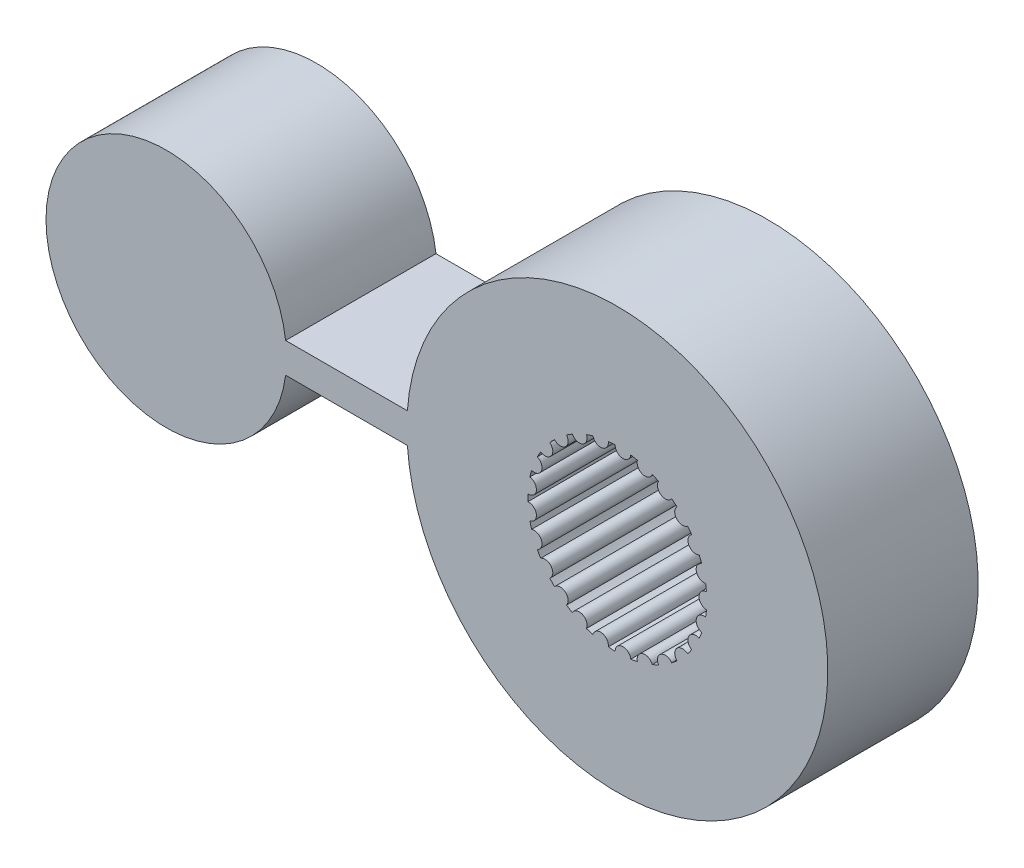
ISO-10303-21;
HEADER;
FILE_DESCRIPTION(('STEP AP214'),'2;1');
FILE_NAME('part.step','',(''),(''),'','','');
FILE_SCHEMA(('AUTOMOTIVE_DESIGN { 1 0 10303 214 1 1 1 1 }'));
ENDSEC;
DATA;
#1=APPLICATION_CONTEXT('core data for automotive mechanical design processes');
#2=APPLICATION_PROTOCOL_DEFINITION('international standard','automotive_design',2000,#1);
#3=PRODUCT_CONTEXT('',#1,'mechanical');
#4=PRODUCT('Part','Part','',(#3));
#5=PRODUCT_RELATED_PRODUCT_CATEGORY('part','',(#4));
#6=PRODUCT_DEFINITION_FORMATION('','',#4);
#7=PRODUCT_DEFINITION_CONTEXT('part definition',#1,'design');
#8=PRODUCT_DEFINITION('design','',#6,#7);
#9=PRODUCT_DEFINITION_SHAPE('','',#8);
#10=(LENGTH_UNIT() NAMED_UNIT(*) SI_UNIT(.MILLI.,.METRE.));
#11=(NAMED_UNIT(*) PLANE_ANGLE_UNIT() SI_UNIT($,.RADIAN.));
#12=(NAMED_UNIT(*) SI_UNIT($,.STERADIAN.) SOLID_ANGLE_UNIT());
#13=UNCERTAINTY_MEASURE_WITH_UNIT(LENGTH_MEASURE(1.E-05),#10,'distance_accuracy_value','');
#14=(GEOMETRIC_REPRESENTATION_CONTEXT(3) GLOBAL_UNCERTAINTY_ASSIGNED_CONTEXT((#13)) GLOBAL_UNIT_ASSIGNED_CONTEXT((#10,
#11,#12)) REPRESENTATION_CONTEXT('',''));
#15=CARTESIAN_POINT('',(0.,0.,0.));
#16=DIRECTION('',(0.,0.,1.));
#17=DIRECTION('',(1.,0.,0.));
#18=AXIS2_PLACEMENT_3D('',#15,#16,#17);
#19=CARTESIAN_POINT('',(0.,0.,5.));
#20=DIRECTION('',(0.,0.,-1.));
#21=DIRECTION('',(-1.,0.,0.));
#22=AXIS2_PLACEMENT_3D('',#19,#20,#21);
#23=CYLINDRICAL_SURFACE('',#22,2.975);
#24=DIRECTION('',(0.,0.,1.));
#25=VECTOR('',#24,1.);
#26=CARTESIAN_POINT('',(2.93512810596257,0.485435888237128,2.5));
#27=LINE('',#26,#25);
#28=CARTESIAN_POINT('',(2.93512810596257,0.485435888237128,0.));
#29=VERTEX_POINT('',#28);
#30=CARTESIAN_POINT('',(2.93512810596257,0.485435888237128,5.));
#31=VERTEX_POINT('',#30);
#32=EDGE_CURVE('E390',#29,#31,#27,.T.);
#33=ORIENTED_EDGE('',*,*,#32,.F.);
#34=CARTESIAN_POINT('',(0.,0.,0.));
#35=DIRECTION('',(0.,0.,1.));
#36=DIRECTION('',(1.,0.,0.));
#37=AXIS2_PLACEMENT_3D('',#34,#35,#36);
#38=CIRCLE('',#37,2.975);
#39=CARTESIAN_POINT('',(2.96363865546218,0.259751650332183,0.));
#40=VERTEX_POINT('',#39);
#41=EDGE_CURVE('E674',#40,#29,#38,.T.);
#42=ORIENTED_EDGE('',*,*,#41,.F.);
#43=DIRECTION('',(0.,0.,1.));
#44=VECTOR('',#43,1.);
#45=CARTESIAN_POINT('',(2.96363865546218,0.259751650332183,2.5));
#46=LINE('',#45,#44);
#47=CARTESIAN_POINT('',(2.96363865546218,0.259751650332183,5.));
#48=VERTEX_POINT('',#47);
#49=EDGE_CURVE('E706',#48,#40,#46,.F.);
#50=ORIENTED_EDGE('',*,*,#49,.F.);
#51=CARTESIAN_POINT('',(0.,0.,5.));
#52=DIRECTION('',(0.,0.,1.));
#53=DIRECTION('',(1.,0.,0.));
#54=AXIS2_PLACEMENT_3D('',#51,#52,#53);
#55=CIRCLE('',#54,2.975);
#56=EDGE_CURVE('E48',#48,#31,#55,.T.);
#57=ORIENTED_EDGE('',*,*,#56,.T.);
#58=EDGE_LOOP('',(#33,#42,#50,#57));
#59=FACE_BOUND('',#58,.T.);
#60=ADVANCED_FACE('F33',(#59),#23,.F.);
#61=DIRECTION('',(0.,0.,1.));
#62=VECTOR('',#61,1.);
#63=CARTESIAN_POINT('',(2.80593288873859,0.98861803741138,2.5));
#64=LINE('',#63,#62);
#65=CARTESIAN_POINT('',(2.80593288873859,0.98861803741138,5.));
#66=VERTEX_POINT('',#65);
#67=CARTESIAN_POINT('',(2.80593288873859,0.98861803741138,0.));
#68=VERTEX_POINT('',#67);
#69=EDGE_CURVE('E385',#66,#68,#64,.F.);
#70=ORIENTED_EDGE('',*,*,#69,.F.);
#71=CARTESIAN_POINT('',(2.72219266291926,1.20012170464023,5.));
#72=VERTEX_POINT('',#71);
#73=EDGE_CURVE('E375',#66,#72,#55,.T.);
#74=ORIENTED_EDGE('',*,*,#73,.T.);
#75=DIRECTION('',(0.,0.,1.));
#76=VECTOR('',#75,1.);
#77=CARTESIAN_POINT('',(2.72219266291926,1.20012170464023,2.5));
#78=LINE('',#77,#76);
#79=CARTESIAN_POINT('',(2.72219266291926,1.20012170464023,0.));
#80=VERTEX_POINT('',#79);
#81=EDGE_CURVE('E405',#80,#72,#78,.T.);
#82=ORIENTED_EDGE('',*,*,#81,.F.);
#83=EDGE_CURVE('E56',#68,#80,#38,.T.);
#84=ORIENTED_EDGE('',*,*,#83,.F.);
#85=EDGE_LOOP('',(#70,#74,#82,#84));
#86=FACE_BOUND('',#85,.T.);
#87=ADVANCED_FACE('F386',(#86),#23,.F.);
#88=DIRECTION('',(0.,0.,1.));
#89=VECTOR('',#88,1.);
#90=CARTESIAN_POINT('',(2.47192003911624,1.65536591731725,2.5));
#91=LINE('',#90,#89);
#92=CARTESIAN_POINT('',(2.47192003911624,1.65536591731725,5.));
#93=VERTEX_POINT('',#92);
#94=CARTESIAN_POINT('',(2.47192003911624,1.65536591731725,0.));
#95=VERTEX_POINT('',#94);
#96=EDGE_CURVE('E401',#93,#95,#91,.F.);
#97=ORIENTED_EDGE('',*,*,#96,.F.);
#98=CARTESIAN_POINT('',(2.33821184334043,1.8393994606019,5.));
#99=VERTEX_POINT('',#98);
#100=EDGE_CURVE('E383',#93,#99,#55,.T.);
#101=ORIENTED_EDGE('',*,*,#100,.T.);
#102=DIRECTION('',(0.,0.,1.));
#103=VECTOR('',#102,1.);
#104=CARTESIAN_POINT('',(2.33821184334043,1.8393994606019,2.5));
#105=LINE('',#104,#103);
#106=CARTESIAN_POINT('',(2.33821184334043,1.8393994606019,0.));
#107=VERTEX_POINT('',#106);
#108=EDGE_CURVE('E416',#107,#99,#105,.T.);
#109=ORIENTED_EDGE('',*,*,#108,.F.);
#110=EDGE_CURVE('E824',#95,#107,#38,.T.);
#111=ORIENTED_EDGE('',*,*,#110,.F.);
#112=EDGE_LOOP('',(#97,#101,#109,#111));
#113=FACE_BOUND('',#112,.T.);
#114=ADVANCED_FACE('F814',(#113),#23,.F.);
#115=DIRECTION('',(0.,0.,1.));
#116=VECTOR('',#115,1.);
#117=CARTESIAN_POINT('',(1.98258736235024,2.2181010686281,2.5));
#118=LINE('',#117,#116);
#119=CARTESIAN_POINT('',(1.98258736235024,2.2181010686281,5.));
#120=VERTEX_POINT('',#119);
#121=CARTESIAN_POINT('',(1.98258736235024,2.2181010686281,0.));
#122=VERTEX_POINT('',#121);
#123=EDGE_CURVE('E411',#120,#122,#118,.F.);
#124=ORIENTED_EDGE('',*,*,#123,.F.);
#125=CARTESIAN_POINT('',(1.80731257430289,2.36310098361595,5.));
#126=VERTEX_POINT('',#125);
#127=EDGE_CURVE('E804',#120,#126,#55,.T.);
#128=ORIENTED_EDGE('',*,*,#127,.T.);
#129=DIRECTION('',(0.,0.,1.));
#130=VECTOR('',#129,1.);
#131=CARTESIAN_POINT('',(1.80731257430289,2.36310098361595,2.5));
#132=LINE('',#131,#130);
#133=CARTESIAN_POINT('',(1.80731257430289,2.36310098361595,0.));
#134=VERTEX_POINT('',#133);
#135=EDGE_CURVE('E428',#134,#126,#132,.T.);
#136=ORIENTED_EDGE('',*,*,#135,.F.);
#137=EDGE_CURVE('E821',#122,#134,#38,.T.);
#138=ORIENTED_EDGE('',*,*,#137,.F.);
#139=EDGE_LOOP('',(#124,#128,#136,#138));
#140=FACE_BOUND('',#139,.T.);
#141=ADVANCED_FACE('F820',(#140),#23,.F.);
#142=DIRECTION('',(0.,0.,1.));
#143=VECTOR('',#142,1.);
#144=CARTESIAN_POINT('',(1.3686814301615,2.64146477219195,2.5));
#145=LINE('',#144,#143);
#146=CARTESIAN_POINT('',(1.3686814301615,2.64146477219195,5.));
#147=VERTEX_POINT('',#146);
#148=CARTESIAN_POINT('',(1.3686814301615,2.64146477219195,0.));
#149=VERTEX_POINT('',#148);
#150=EDGE_CURVE('E423',#147,#149,#145,.F.);
#151=ORIENTED_EDGE('',*,*,#150,.F.);
#152=CARTESIAN_POINT('',(1.16285320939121,2.73832018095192,5.));
#153=VERTEX_POINT('',#152);
#154=EDGE_CURVE('E800',#147,#153,#55,.T.);
#155=ORIENTED_EDGE('',*,*,#154,.T.);
#156=DIRECTION('',(0.,0.,1.));
#157=VECTOR('',#156,1.);
#158=CARTESIAN_POINT('',(1.16285320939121,2.73832018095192,2.5));
#159=LINE('',#158,#157);
#160=CARTESIAN_POINT('',(1.16285320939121,2.73832018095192,0.));
#161=VERTEX_POINT('',#160);
#162=EDGE_CURVE('E440',#161,#153,#159,.T.);
#163=ORIENTED_EDGE('',*,*,#162,.F.);
#164=EDGE_CURVE('E825',#149,#161,#38,.T.);
#165=ORIENTED_EDGE('',*,*,#164,.F.);
#166=EDGE_LOOP('',(#151,#155,#163,#165));
#167=FACE_BOUND('',#166,.T.);
#168=ADVANCED_FACE('F936',(#167),#23,.F.);
#169=DIRECTION('',(0.,0.,1.));
#170=VECTOR('',#169,1.);
#171=CARTESIAN_POINT('',(0.668776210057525,2.89885552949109,2.5));
#172=LINE('',#171,#170);
#173=CARTESIAN_POINT('',(0.668776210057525,2.89885552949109,5.));
#174=VERTEX_POINT('',#173);
#175=CARTESIAN_POINT('',(0.668776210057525,2.89885552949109,0.));
#176=VERTEX_POINT('',#175);
#177=EDGE_CURVE('E435',#174,#176,#172,.F.);
#178=ORIENTED_EDGE('',*,*,#177,.F.);
#179=CARTESIAN_POINT('',(0.445327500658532,2.94148065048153,5.));
#180=VERTEX_POINT('',#179);
#181=EDGE_CURVE('E796',#174,#180,#55,.T.);
#182=ORIENTED_EDGE('',*,*,#181,.T.);
#183=DIRECTION('',(0.,0.,1.));
#184=VECTOR('',#183,1.);
#185=CARTESIAN_POINT('',(0.445327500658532,2.94148065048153,2.5));
#186=LINE('',#185,#184);
#187=CARTESIAN_POINT('',(0.445327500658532,2.94148065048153,0.));
#188=VERTEX_POINT('',#187);
#189=EDGE_CURVE('E452',#188,#180,#186,.T.);
#190=ORIENTED_EDGE('',*,*,#189,.F.);
#191=EDGE_CURVE('E826',#176,#188,#38,.T.);
#192=ORIENTED_EDGE('',*,*,#191,.F.);
#193=EDGE_LOOP('',(#178,#182,#190,#192));
#194=FACE_BOUND('',#193,.T.);
#195=ADVANCED_FACE('F932',(#194),#23,.F.);
#196=DIRECTION('',(0.,0.,1.));
#197=VECTOR('',#196,1.);
#198=CARTESIAN_POINT('',(-0.0731506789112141,2.97410053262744,2.5));
#199=LINE('',#198,#197);
#200=CARTESIAN_POINT('',(-0.0731506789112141,2.97410053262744,5.));
#201=VERTEX_POINT('',#200);
#202=CARTESIAN_POINT('',(-0.0731506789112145,2.97410053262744,0.));
#203=VERTEX_POINT('',#202);
#204=EDGE_CURVE('E447',#201,#203,#199,.F.);
#205=ORIENTED_EDGE('',*,*,#204,.F.);
#206=CARTESIAN_POINT('',(-0.300179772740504,2.95981707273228,5.));
#207=VERTEX_POINT('',#206);
#208=EDGE_CURVE('E792',#201,#207,#55,.T.);
#209=ORIENTED_EDGE('',*,*,#208,.T.);
#210=DIRECTION('',(0.,0.,1.));
#211=VECTOR('',#210,1.);
#212=CARTESIAN_POINT('',(-0.300179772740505,2.95981707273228,2.5));
#213=LINE('',#212,#211);
#214=CARTESIAN_POINT('',(-0.300179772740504,2.95981707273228,0.));
#215=VERTEX_POINT('',#214);
#216=EDGE_CURVE('E464',#215,#207,#213,.T.);
#217=ORIENTED_EDGE('',*,*,#216,.F.);
#218=EDGE_CURVE('E828',#203,#215,#38,.T.);
#219=ORIENTED_EDGE('',*,*,#218,.F.);
#220=EDGE_LOOP('',(#205,#209,#217,#219));
#221=FACE_BOUND('',#220,.T.);
#222=ADVANCED_FACE('F929',(#221),#23,.F.);
#223=DIRECTION('',(0.,0.,1.));
#224=VECTOR('',#223,1.);
#225=CARTESIAN_POINT('',(-0.810481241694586,2.86247186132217,2.5));
#226=LINE('',#225,#224);
#227=CARTESIAN_POINT('',(-0.810481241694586,2.86247186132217,5.));
#228=VERTEX_POINT('',#227);
#229=CARTESIAN_POINT('',(-0.810481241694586,2.86247186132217,0.));
#230=VERTEX_POINT('',#229);
#231=EDGE_CURVE('E459',#228,#230,#226,.F.);
#232=ORIENTED_EDGE('',*,*,#231,.F.);
#233=CARTESIAN_POINT('',(-1.02682564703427,2.79217730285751,5.));
#234=VERTEX_POINT('',#233);
#235=EDGE_CURVE('E788',#228,#234,#55,.T.);
#236=ORIENTED_EDGE('',*,*,#235,.T.);
#237=DIRECTION('',(0.,0.,1.));
#238=VECTOR('',#237,1.);
#239=CARTESIAN_POINT('',(-1.02682564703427,2.79217730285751,2.5));
#240=LINE('',#239,#238);
#241=CARTESIAN_POINT('',(-1.02682564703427,2.79217730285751,0.));
#242=VERTEX_POINT('',#241);
#243=EDGE_CURVE('E476',#242,#234,#240,.T.);
#244=ORIENTED_EDGE('',*,*,#243,.F.);
#245=EDGE_CURVE('E830',#230,#242,#38,.T.);
#246=ORIENTED_EDGE('',*,*,#245,.F.);
#247=EDGE_LOOP('',(#232,#236,#244,#246));
#248=FACE_BOUND('',#247,.T.);
#249=ADVANCED_FACE('F924',(#248),#23,.F.);
#250=DIRECTION('',(0.,0.,1.));
#251=VECTOR('',#250,1.);
#252=CARTESIAN_POINT('',(-1.49688628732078,2.57098355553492,2.5));
#253=LINE('',#252,#251);
#254=CARTESIAN_POINT('',(-1.49688628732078,2.57098355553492,5.));
#255=VERTEX_POINT('',#254);
#256=CARTESIAN_POINT('',(-1.49688628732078,2.57098355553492,0.));
#257=VERTEX_POINT('',#256);
#258=EDGE_CURVE('E471',#255,#257,#253,.F.);
#259=ORIENTED_EDGE('',*,*,#258,.F.);
#260=CARTESIAN_POINT('',(-1.68895228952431,2.44909476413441,5.));
#261=VERTEX_POINT('',#260);
#262=EDGE_CURVE('E784',#255,#261,#55,.T.);
#263=ORIENTED_EDGE('',*,*,#262,.T.);
#264=DIRECTION('',(0.,0.,1.));
#265=VECTOR('',#264,1.);
#266=CARTESIAN_POINT('',(-1.68895228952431,2.44909476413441,2.5));
#267=LINE('',#266,#265);
#268=CARTESIAN_POINT('',(-1.68895228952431,2.44909476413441,0.));
#269=VERTEX_POINT('',#268);
#270=EDGE_CURVE('E488',#269,#261,#267,.T.);
#271=ORIENTED_EDGE('',*,*,#270,.F.);
#272=EDGE_CURVE('E832',#257,#269,#38,.T.);
#273=ORIENTED_EDGE('',*,*,#272,.F.);
#274=EDGE_LOOP('',(#259,#263,#271,#273));
#275=FACE_BOUND('',#274,.T.);
#276=ADVANCED_FACE('F921',(#275),#23,.F.);
#277=DIRECTION('',(0.,0.,1.));
#278=VECTOR('',#277,1.);
#279=CARTESIAN_POINT('',(-2.08923646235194,2.11795089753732,2.5));
#280=LINE('',#279,#278);
#281=CARTESIAN_POINT('',(-2.08923646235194,2.11795089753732,5.));
#282=VERTEX_POINT('',#281);
#283=CARTESIAN_POINT('',(-2.08923646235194,2.11795089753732,0.));
#284=VERTEX_POINT('',#283);
#285=EDGE_CURVE('E483',#282,#284,#280,.F.);
#286=ORIENTED_EDGE('',*,*,#285,.F.);
#287=CARTESIAN_POINT('',(-2.24495584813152,1.95212659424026,5.));
#288=VERTEX_POINT('',#287);
#289=EDGE_CURVE('E780',#282,#288,#55,.T.);
#290=ORIENTED_EDGE('',*,*,#289,.T.);
#291=DIRECTION('',(0.,0.,1.));
#292=VECTOR('',#291,1.);
#293=CARTESIAN_POINT('',(-2.24495584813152,1.95212659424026,2.5));
#294=LINE('',#293,#292);
#295=CARTESIAN_POINT('',(-2.24495584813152,1.95212659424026,0.));
#296=VERTEX_POINT('',#295);
#297=EDGE_CURVE('E500',#296,#288,#294,.T.);
#298=ORIENTED_EDGE('',*,*,#297,.F.);
#299=EDGE_CURVE('E834',#284,#296,#38,.T.);
#300=ORIENTED_EDGE('',*,*,#299,.F.);
#301=EDGE_LOOP('',(#286,#290,#298,#300));
#302=FACE_BOUND('',#301,.T.);
#303=ADVANCED_FACE('F916',(#302),#23,.F.);
#304=DIRECTION('',(0.,0.,1.));
#305=VECTOR('',#304,1.);
#306=CARTESIAN_POINT('',(-2.5503122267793,1.53183959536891,2.5));
#307=LINE('',#306,#305);
#308=CARTESIAN_POINT('',(-2.5503122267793,1.53183959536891,5.));
#309=VERTEX_POINT('',#308);
#310=CARTESIAN_POINT('',(-2.5503122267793,1.53183959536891,0.));
#311=VERTEX_POINT('',#310);
#312=EDGE_CURVE('E495',#309,#311,#307,.F.);
#313=ORIENTED_EDGE('',*,*,#312,.F.);
#314=CARTESIAN_POINT('',(-2.65990057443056,1.33249913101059,5.));
#315=VERTEX_POINT('',#314);
#316=EDGE_CURVE('E776',#309,#315,#55,.T.);
#317=ORIENTED_EDGE('',*,*,#316,.T.);
#318=DIRECTION('',(0.,0.,1.));
#319=VECTOR('',#318,1.);
#320=CARTESIAN_POINT('',(-2.65990057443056,1.33249913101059,2.5));
#321=LINE('',#320,#319);
#322=CARTESIAN_POINT('',(-2.65990057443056,1.33249913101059,0.));
#323=VERTEX_POINT('',#322);
#324=EDGE_CURVE('E512',#323,#315,#321,.T.);
#325=ORIENTED_EDGE('',*,*,#324,.F.);
#326=EDGE_CURVE('E836',#311,#323,#38,.T.);
#327=ORIENTED_EDGE('',*,*,#326,.F.);
#328=EDGE_LOOP('',(#313,#317,#325,#327));
#329=FACE_BOUND('',#328,.T.);
#330=ADVANCED_FACE('F913',(#329),#23,.F.);
#331=DIRECTION('',(0.,0.,1.));
#332=VECTOR('',#331,1.);
#333=CARTESIAN_POINT('',(-2.85114249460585,0.849477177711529,2.5));
#334=LINE('',#333,#332);
#335=CARTESIAN_POINT('',(-2.85114249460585,0.849477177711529,5.));
#336=VERTEX_POINT('',#335);
#337=CARTESIAN_POINT('',(-2.85114249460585,0.849477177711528,0.));
#338=VERTEX_POINT('',#337);
#339=EDGE_CURVE('E507',#336,#338,#334,.F.);
#340=ORIENTED_EDGE('',*,*,#339,.F.);
#341=CARTESIAN_POINT('',(-2.9077139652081,0.629145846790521,5.));
#342=VERTEX_POINT('',#341);
#343=EDGE_CURVE('E772',#336,#342,#55,.T.);
#344=ORIENTED_EDGE('',*,*,#343,.T.);
#345=DIRECTION('',(0.,0.,1.));
#346=VECTOR('',#345,1.);
#347=CARTESIAN_POINT('',(-2.9077139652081,0.62914584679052,2.5));
#348=LINE('',#347,#346);
#349=CARTESIAN_POINT('',(-2.9077139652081,0.629145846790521,0.));
#350=VERTEX_POINT('',#349);
#351=EDGE_CURVE('E524',#350,#342,#348,.T.);
#352=ORIENTED_EDGE('',*,*,#351,.F.);
#353=EDGE_CURVE('E838',#338,#350,#38,.T.);
#354=ORIENTED_EDGE('',*,*,#353,.F.);
#355=EDGE_LOOP('',(#340,#344,#352,#354));
#356=FACE_BOUND('',#355,.T.);
#357=ADVANCED_FACE('F908',(#356),#23,.F.);
#358=DIRECTION('',(0.,0.,1.));
#359=VECTOR('',#358,1.);
#360=CARTESIAN_POINT('',(-2.9728249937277,0.113738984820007,2.5));
#361=LINE('',#360,#359);
#362=CARTESIAN_POINT('',(-2.9728249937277,0.113738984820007,5.));
#363=VERTEX_POINT('',#362);
#364=CARTESIAN_POINT('',(-2.9728249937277,0.113738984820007,0.));
#365=VERTEX_POINT('',#364);
#366=EDGE_CURVE('E519',#363,#365,#361,.F.);
#367=ORIENTED_EDGE('',*,*,#366,.F.);
#368=CARTESIAN_POINT('',(-2.97282499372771,-0.113738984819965,5.));
#369=VERTEX_POINT('',#368);
#370=EDGE_CURVE('E768',#363,#369,#55,.T.);
#371=ORIENTED_EDGE('',*,*,#370,.T.);
#372=DIRECTION('',(0.,0.,1.));
#373=VECTOR('',#372,1.);
#374=CARTESIAN_POINT('',(-2.97282499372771,-0.113738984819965,2.5));
#375=LINE('',#374,#373);
#376=CARTESIAN_POINT('',(-2.97282499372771,-0.113738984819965,0.));
#377=VERTEX_POINT('',#376);
#378=EDGE_CURVE('E536',#377,#369,#375,.T.);
#379=ORIENTED_EDGE('',*,*,#378,.F.);
#380=EDGE_CURVE('E840',#365,#377,#38,.T.);
#381=ORIENTED_EDGE('',*,*,#380,.F.);
#382=EDGE_LOOP('',(#367,#371,#379,#381));
#383=FACE_BOUND('',#382,.T.);
#384=ADVANCED_FACE('F905',(#383),#23,.F.);
#385=DIRECTION('',(0.,0.,1.));
#386=VECTOR('',#385,1.);
#387=CARTESIAN_POINT('',(-2.90771396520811,-0.62914584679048,2.5));
#388=LINE('',#387,#386);
#389=CARTESIAN_POINT('',(-2.90771396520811,-0.62914584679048,5.));
#390=VERTEX_POINT('',#389);
#391=CARTESIAN_POINT('',(-2.90771396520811,-0.62914584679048,0.));
#392=VERTEX_POINT('',#391);
#393=EDGE_CURVE('E531',#390,#392,#388,.F.);
#394=ORIENTED_EDGE('',*,*,#393,.F.);
#395=CARTESIAN_POINT('',(-2.85114249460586,-0.849477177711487,5.));
#396=VERTEX_POINT('',#395);
#397=EDGE_CURVE('E764',#390,#396,#55,.T.);
#398=ORIENTED_EDGE('',*,*,#397,.T.);
#399=DIRECTION('',(0.,0.,1.));
#400=VECTOR('',#399,1.);
#401=CARTESIAN_POINT('',(-2.85114249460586,-0.849477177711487,2.5));
#402=LINE('',#401,#400);
#403=CARTESIAN_POINT('',(-2.85114249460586,-0.849477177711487,0.));
#404=VERTEX_POINT('',#403);
#405=EDGE_CURVE('E548',#404,#396,#402,.T.);
#406=ORIENTED_EDGE('',*,*,#405,.F.);
#407=EDGE_CURVE('E842',#392,#404,#38,.T.);
#408=ORIENTED_EDGE('',*,*,#407,.F.);
#409=EDGE_LOOP('',(#394,#398,#406,#408));
#410=FACE_BOUND('',#409,.T.);
#411=ADVANCED_FACE('F900',(#410),#23,.F.);
#412=DIRECTION('',(0.,0.,1.));
#413=VECTOR('',#412,1.);
#414=CARTESIAN_POINT('',(-2.65990057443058,-1.33249913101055,2.5));
#415=LINE('',#414,#413);
#416=CARTESIAN_POINT('',(-2.65990057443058,-1.33249913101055,5.));
#417=VERTEX_POINT('',#416);
#418=CARTESIAN_POINT('',(-2.65990057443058,-1.33249913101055,0.));
#419=VERTEX_POINT('',#418);
#420=EDGE_CURVE('E543',#417,#419,#415,.F.);
#421=ORIENTED_EDGE('',*,*,#420,.F.);
#422=CARTESIAN_POINT('',(-2.55031222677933,-1.53183959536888,5.));
#423=VERTEX_POINT('',#422);
#424=EDGE_CURVE('E760',#417,#423,#55,.T.);
#425=ORIENTED_EDGE('',*,*,#424,.T.);
#426=DIRECTION('',(0.,0.,1.));
#427=VECTOR('',#426,1.);
#428=CARTESIAN_POINT('',(-2.55031222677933,-1.53183959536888,2.5));
#429=LINE('',#428,#427);
#430=CARTESIAN_POINT('',(-2.55031222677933,-1.53183959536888,0.));
#431=VERTEX_POINT('',#430);
#432=EDGE_CURVE('E560',#431,#423,#429,.T.);
#433=ORIENTED_EDGE('',*,*,#432,.F.);
#434=EDGE_CURVE('E844',#419,#431,#38,.T.);
#435=ORIENTED_EDGE('',*,*,#434,.F.);
#436=EDGE_LOOP('',(#421,#425,#433,#435));
#437=FACE_BOUND('',#436,.T.);
#438=ADVANCED_FACE('F897',(#437),#23,.F.);
#439=DIRECTION('',(0.,0.,1.));
#440=VECTOR('',#439,1.);
#441=CARTESIAN_POINT('',(-2.24495584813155,-1.95212659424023,2.5));
#442=LINE('',#441,#440);
#443=CARTESIAN_POINT('',(-2.24495584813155,-1.95212659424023,5.));
#444=VERTEX_POINT('',#443);
#445=CARTESIAN_POINT('',(-2.24495584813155,-1.95212659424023,0.));
#446=VERTEX_POINT('',#445);
#447=EDGE_CURVE('E555',#444,#446,#442,.F.);
#448=ORIENTED_EDGE('',*,*,#447,.F.);
#449=CARTESIAN_POINT('',(-2.08923646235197,-2.11795089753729,5.));
#450=VERTEX_POINT('',#449);
#451=EDGE_CURVE('E756',#444,#450,#55,.T.);
#452=ORIENTED_EDGE('',*,*,#451,.T.);
#453=DIRECTION('',(0.,0.,1.));
#454=VECTOR('',#453,1.);
#455=CARTESIAN_POINT('',(-2.08923646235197,-2.11795089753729,2.5));
#456=LINE('',#455,#454);
#457=CARTESIAN_POINT('',(-2.08923646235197,-2.11795089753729,0.));
#458=VERTEX_POINT('',#457);
#459=EDGE_CURVE('E572',#458,#450,#456,.T.);
#460=ORIENTED_EDGE('',*,*,#459,.F.);
#461=EDGE_CURVE('E846',#446,#458,#38,.T.);
#462=ORIENTED_EDGE('',*,*,#461,.F.);
#463=EDGE_LOOP('',(#448,#452,#460,#462));
#464=FACE_BOUND('',#463,.T.);
#465=ADVANCED_FACE('F892',(#464),#23,.F.);
#466=DIRECTION('',(0.,0.,1.));
#467=VECTOR('',#466,1.);
#468=CARTESIAN_POINT('',(-1.68895228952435,-2.44909476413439,2.5));
#469=LINE('',#468,#467);
#470=CARTESIAN_POINT('',(-1.68895228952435,-2.44909476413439,5.));
#471=VERTEX_POINT('',#470);
#472=CARTESIAN_POINT('',(-1.68895228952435,-2.44909476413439,0.));
#473=VERTEX_POINT('',#472);
#474=EDGE_CURVE('E567',#471,#473,#469,.F.);
#475=ORIENTED_EDGE('',*,*,#474,.F.);
#476=CARTESIAN_POINT('',(-1.49688628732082,-2.5709835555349,5.));
#477=VERTEX_POINT('',#476);
#478=EDGE_CURVE('E752',#471,#477,#55,.T.);
#479=ORIENTED_EDGE('',*,*,#478,.T.);
#480=DIRECTION('',(0.,0.,1.));
#481=VECTOR('',#480,1.);
#482=CARTESIAN_POINT('',(-1.49688628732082,-2.5709835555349,2.5));
#483=LINE('',#482,#481);
#484=CARTESIAN_POINT('',(-1.49688628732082,-2.5709835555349,0.));
#485=VERTEX_POINT('',#484);
#486=EDGE_CURVE('E584',#485,#477,#483,.T.);
#487=ORIENTED_EDGE('',*,*,#486,.F.);
#488=EDGE_CURVE('E848',#473,#485,#38,.T.);
#489=ORIENTED_EDGE('',*,*,#488,.F.);
#490=EDGE_LOOP('',(#475,#479,#487,#489));
#491=FACE_BOUND('',#490,.T.);
#492=ADVANCED_FACE('F889',(#491),#23,.F.);
#493=DIRECTION('',(0.,0.,1.));
#494=VECTOR('',#493,1.);
#495=CARTESIAN_POINT('',(-1.02682564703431,-2.7921773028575,2.5));
#496=LINE('',#495,#494);
#497=CARTESIAN_POINT('',(-1.02682564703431,-2.7921773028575,5.));
#498=VERTEX_POINT('',#497);
#499=CARTESIAN_POINT('',(-1.02682564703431,-2.7921773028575,0.));
#500=VERTEX_POINT('',#499);
#501=EDGE_CURVE('E579',#498,#500,#496,.F.);
#502=ORIENTED_EDGE('',*,*,#501,.F.);
#503=CARTESIAN_POINT('',(-0.810481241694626,-2.86247186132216,5.));
#504=VERTEX_POINT('',#503);
#505=EDGE_CURVE('E748',#498,#504,#55,.T.);
#506=ORIENTED_EDGE('',*,*,#505,.T.);
#507=DIRECTION('',(0.,0.,1.));
#508=VECTOR('',#507,1.);
#509=CARTESIAN_POINT('',(-0.810481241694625,-2.86247186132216,2.5));
#510=LINE('',#509,#508);
#511=CARTESIAN_POINT('',(-0.810481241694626,-2.86247186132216,0.));
#512=VERTEX_POINT('',#511);
#513=EDGE_CURVE('E596',#512,#504,#510,.T.);
#514=ORIENTED_EDGE('',*,*,#513,.F.);
#515=EDGE_CURVE('E850',#500,#512,#38,.T.);
#516=ORIENTED_EDGE('',*,*,#515,.F.);
#517=EDGE_LOOP('',(#502,#506,#514,#516));
#518=FACE_BOUND('',#517,.T.);
#519=ADVANCED_FACE('F884',(#518),#23,.F.);
#520=DIRECTION('',(0.,0.,1.));
#521=VECTOR('',#520,1.);
#522=CARTESIAN_POINT('',(-0.300179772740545,-2.95981707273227,2.5));
#523=LINE('',#522,#521);
#524=CARTESIAN_POINT('',(-0.300179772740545,-2.95981707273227,5.));
#525=VERTEX_POINT('',#524);
#526=CARTESIAN_POINT('',(-0.300179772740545,-2.95981707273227,0.));
#527=VERTEX_POINT('',#526);
#528=EDGE_CURVE('E591',#525,#527,#523,.F.);
#529=ORIENTED_EDGE('',*,*,#528,.F.);
#530=CARTESIAN_POINT('',(-0.0731506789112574,-2.97410053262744,5.));
#531=VERTEX_POINT('',#530);
#532=EDGE_CURVE('E744',#525,#531,#55,.T.);
#533=ORIENTED_EDGE('',*,*,#532,.T.);
#534=DIRECTION('',(0.,0.,1.));
#535=VECTOR('',#534,1.);
#536=CARTESIAN_POINT('',(-0.0731506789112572,-2.97410053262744,2.5));
#537=LINE('',#536,#535);
#538=CARTESIAN_POINT('',(-0.0731506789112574,-2.97410053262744,0.));
#539=VERTEX_POINT('',#538);
#540=EDGE_CURVE('E608',#539,#531,#537,.T.);
#541=ORIENTED_EDGE('',*,*,#540,.F.);
#542=EDGE_CURVE('E852',#527,#539,#38,.T.);
#543=ORIENTED_EDGE('',*,*,#542,.F.);
#544=EDGE_LOOP('',(#529,#533,#541,#543));
#545=FACE_BOUND('',#544,.T.);
#546=ADVANCED_FACE('F881',(#545),#23,.F.);
#547=DIRECTION('',(0.,0.,1.));
#548=VECTOR('',#547,1.);
#549=CARTESIAN_POINT('',(0.44532750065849,-2.94148065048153,2.5));
#550=LINE('',#549,#548);
#551=CARTESIAN_POINT('',(0.44532750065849,-2.94148065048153,5.));
#552=VERTEX_POINT('',#551);
#553=CARTESIAN_POINT('',(0.44532750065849,-2.94148065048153,0.));
#554=VERTEX_POINT('',#553);
#555=EDGE_CURVE('E603',#552,#554,#550,.F.);
#556=ORIENTED_EDGE('',*,*,#555,.F.);
#557=CARTESIAN_POINT('',(0.668776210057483,-2.8988555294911,5.));
#558=VERTEX_POINT('',#557);
#559=EDGE_CURVE('E740',#552,#558,#55,.T.);
#560=ORIENTED_EDGE('',*,*,#559,.T.);
#561=DIRECTION('',(0.,0.,1.));
#562=VECTOR('',#561,1.);
#563=CARTESIAN_POINT('',(0.668776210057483,-2.8988555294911,2.5));
#564=LINE('',#563,#562);
#565=CARTESIAN_POINT('',(0.668776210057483,-2.8988555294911,0.));
#566=VERTEX_POINT('',#565);
#567=EDGE_CURVE('E620',#566,#558,#564,.T.);
#568=ORIENTED_EDGE('',*,*,#567,.F.);
#569=EDGE_CURVE('E854',#554,#566,#38,.T.);
#570=ORIENTED_EDGE('',*,*,#569,.F.);
#571=EDGE_LOOP('',(#556,#560,#568,#570));
#572=FACE_BOUND('',#571,.T.);
#573=ADVANCED_FACE('F876',(#572),#23,.F.);
#574=DIRECTION('',(0.,0.,1.));
#575=VECTOR('',#574,1.);
#576=CARTESIAN_POINT('',(1.16285320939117,-2.73832018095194,2.5));
#577=LINE('',#576,#575);
#578=CARTESIAN_POINT('',(1.16285320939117,-2.73832018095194,5.));
#579=VERTEX_POINT('',#578);
#580=CARTESIAN_POINT('',(1.16285320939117,-2.73832018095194,0.));
#581=VERTEX_POINT('',#580);
#582=EDGE_CURVE('E615',#579,#581,#577,.F.);
#583=ORIENTED_EDGE('',*,*,#582,.F.);
#584=CARTESIAN_POINT('',(1.36868143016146,-2.64146477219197,5.));
#585=VERTEX_POINT('',#584);
#586=EDGE_CURVE('E736',#579,#585,#55,.T.);
#587=ORIENTED_EDGE('',*,*,#586,.T.);
#588=DIRECTION('',(0.,0.,1.));
#589=VECTOR('',#588,1.);
#590=CARTESIAN_POINT('',(1.36868143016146,-2.64146477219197,2.5));
#591=LINE('',#590,#589);
#592=CARTESIAN_POINT('',(1.36868143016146,-2.64146477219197,0.));
#593=VERTEX_POINT('',#592);
#594=EDGE_CURVE('E632',#593,#585,#591,.T.);
#595=ORIENTED_EDGE('',*,*,#594,.F.);
#596=EDGE_CURVE('E856',#581,#593,#38,.T.);
#597=ORIENTED_EDGE('',*,*,#596,.F.);
#598=EDGE_LOOP('',(#583,#587,#595,#597));
#599=FACE_BOUND('',#598,.T.);
#600=ADVANCED_FACE('F873',(#599),#23,.F.);
#601=DIRECTION('',(0.,0.,1.));
#602=VECTOR('',#601,1.);
#603=CARTESIAN_POINT('',(1.80731257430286,-2.36310098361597,2.5));
#604=LINE('',#603,#602);
#605=CARTESIAN_POINT('',(1.80731257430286,-2.36310098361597,5.));
#606=VERTEX_POINT('',#605);
#607=CARTESIAN_POINT('',(1.80731257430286,-2.36310098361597,0.));
#608=VERTEX_POINT('',#607);
#609=EDGE_CURVE('E627',#606,#608,#604,.F.);
#610=ORIENTED_EDGE('',*,*,#609,.F.);
#611=CARTESIAN_POINT('',(1.98258736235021,-2.21810106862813,5.));
#612=VERTEX_POINT('',#611);
#613=EDGE_CURVE('E732',#606,#612,#55,.T.);
#614=ORIENTED_EDGE('',*,*,#613,.T.);
#615=DIRECTION('',(0.,0.,1.));
#616=VECTOR('',#615,1.);
#617=CARTESIAN_POINT('',(1.98258736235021,-2.21810106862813,2.5));
#618=LINE('',#617,#616);
#619=CARTESIAN_POINT('',(1.98258736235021,-2.21810106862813,0.));
#620=VERTEX_POINT('',#619);
#621=EDGE_CURVE('E644',#620,#612,#618,.T.);
#622=ORIENTED_EDGE('',*,*,#621,.F.);
#623=EDGE_CURVE('E858',#608,#620,#38,.T.);
#624=ORIENTED_EDGE('',*,*,#623,.F.);
#625=EDGE_LOOP('',(#610,#614,#622,#624));
#626=FACE_BOUND('',#625,.T.);
#627=ADVANCED_FACE('F868',(#626),#23,.F.);
#628=DIRECTION('',(0.,0.,1.));
#629=VECTOR('',#628,1.);
#630=CARTESIAN_POINT('',(2.3382118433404,-1.83939946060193,2.5));
#631=LINE('',#630,#629);
#632=CARTESIAN_POINT('',(2.3382118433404,-1.83939946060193,5.));
#633=VERTEX_POINT('',#632);
#634=CARTESIAN_POINT('',(2.3382118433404,-1.83939946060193,0.));
#635=VERTEX_POINT('',#634);
#636=EDGE_CURVE('E639',#633,#635,#631,.F.);
#637=ORIENTED_EDGE('',*,*,#636,.F.);
#638=CARTESIAN_POINT('',(2.47192003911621,-1.65536591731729,5.));
#639=VERTEX_POINT('',#638);
#640=EDGE_CURVE('E731',#633,#639,#55,.T.);
#641=ORIENTED_EDGE('',*,*,#640,.T.);
#642=DIRECTION('',(0.,0.,1.));
#643=VECTOR('',#642,1.);
#644=CARTESIAN_POINT('',(2.47192003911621,-1.65536591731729,2.5));
#645=LINE('',#644,#643);
#646=CARTESIAN_POINT('',(2.47192003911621,-1.65536591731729,0.));
#647=VERTEX_POINT('',#646);
#648=EDGE_CURVE('E656',#647,#639,#645,.T.);
#649=ORIENTED_EDGE('',*,*,#648,.F.);
#650=EDGE_CURVE('E727',#635,#647,#38,.T.);
#651=ORIENTED_EDGE('',*,*,#650,.F.);
#652=EDGE_LOOP('',(#637,#641,#649,#651));
#653=FACE_BOUND('',#652,.T.);
#654=ADVANCED_FACE('F861',(#653),#23,.F.);
#655=DIRECTION('',(0.,0.,1.));
#656=VECTOR('',#655,1.);
#657=CARTESIAN_POINT('',(2.72219266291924,-1.20012170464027,2.5));
#658=LINE('',#657,#656);
#659=CARTESIAN_POINT('',(2.72219266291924,-1.20012170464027,5.));
#660=VERTEX_POINT('',#659);
#661=CARTESIAN_POINT('',(2.72219266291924,-1.20012170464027,0.));
#662=VERTEX_POINT('',#661);
#663=EDGE_CURVE('E651',#660,#662,#658,.F.);
#664=ORIENTED_EDGE('',*,*,#663,.F.);
#665=CARTESIAN_POINT('',(2.80593288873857,-0.98861803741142,5.));
#666=VERTEX_POINT('',#665);
#667=EDGE_CURVE('E729',#660,#666,#55,.T.);
#668=ORIENTED_EDGE('',*,*,#667,.T.);
#669=DIRECTION('',(0.,0.,1.));
#670=VECTOR('',#669,1.);
#671=CARTESIAN_POINT('',(2.80593288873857,-0.98861803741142,2.5));
#672=LINE('',#671,#670);
#673=CARTESIAN_POINT('',(2.80593288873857,-0.98861803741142,0.));
#674=VERTEX_POINT('',#673);
#675=EDGE_CURVE('E11',#674,#666,#672,.T.);
#676=ORIENTED_EDGE('',*,*,#675,.F.);
#677=EDGE_CURVE('E723',#662,#674,#38,.T.);
#678=ORIENTED_EDGE('',*,*,#677,.F.);
#679=EDGE_LOOP('',(#664,#668,#676,#678));
#680=FACE_BOUND('',#679,.T.);
#681=ADVANCED_FACE('F728',(#680),#23,.F.);
#682=CARTESIAN_POINT('',(-15.,0.,5.));
#683=DIRECTION('',(0.,0.,1.));
#684=DIRECTION('',(1.,0.,0.));
#685=AXIS2_PLACEMENT_3D('',#682,#683,#684);
#686=PLANE('',#685);
#687=ORIENTED_EDGE('',*,*,#73,.F.);
#688=CARTESIAN_POINT('',(2.88153490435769,0.739852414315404,5.));
#689=DIRECTION('',(0.,0.,1.));
#690=DIRECTION('',(1.,0.,0.));
#691=AXIS2_PLACEMENT_3D('',#688,#689,#690);
#692=CIRCLE('',#691,0.26);
#693=EDGE_CURVE('E379',#66,#31,#692,.T.);
#694=ORIENTED_EDGE('',*,*,#693,.T.);
#695=ORIENTED_EDGE('',*,*,#56,.F.);
#696=CARTESIAN_POINT('',(2.975,0.,5.));
#697=DIRECTION('',(0.,0.,1.));
#698=DIRECTION('',(1.,0.,0.));
#699=AXIS2_PLACEMENT_3D('',#696,#697,#698);
#700=CIRCLE('',#699,0.26);
#701=CARTESIAN_POINT('',(2.96363865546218,-0.259751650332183,5.));
#702=VERTEX_POINT('',#701);
#703=EDGE_CURVE('E663',#48,#702,#700,.T.);
#704=ORIENTED_EDGE('',*,*,#703,.T.);
#705=CARTESIAN_POINT('',(2.93512810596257,-0.485435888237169,5.));
#706=VERTEX_POINT('',#705);
#707=EDGE_CURVE('E673',#706,#702,#55,.T.);
#708=ORIENTED_EDGE('',*,*,#707,.F.);
#709=CARTESIAN_POINT('',(2.88153490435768,-0.739852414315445,5.));
#710=DIRECTION('',(0.,0.,1.));
#711=DIRECTION('',(1.,0.,0.));
#712=AXIS2_PLACEMENT_3D('',#709,#710,#711);
#713=CIRCLE('',#712,0.26);
#714=EDGE_CURVE('E659',#706,#666,#713,.T.);
#715=ORIENTED_EDGE('',*,*,#714,.T.);
#716=ORIENTED_EDGE('',*,*,#667,.F.);
#717=CARTESIAN_POINT('',(2.60701237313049,-1.43321718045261,5.));
#718=DIRECTION('',(0.,0.,1.));
#719=DIRECTION('',(1.,0.,0.));
#720=AXIS2_PLACEMENT_3D('',#717,#718,#719);
#721=CIRCLE('',#720,0.26);
#722=EDGE_CURVE('E647',#660,#639,#721,.T.);
#723=ORIENTED_EDGE('',*,*,#722,.T.);
#724=ORIENTED_EDGE('',*,*,#640,.F.);
#725=CARTESIAN_POINT('',(2.1686816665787,-2.03652764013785,5.));
#726=DIRECTION('',(0.,0.,1.));
#727=DIRECTION('',(1.,0.,0.));
#728=AXIS2_PLACEMENT_3D('',#725,#726,#727);
#729=CIRCLE('',#728,0.26);
#730=EDGE_CURVE('E635',#633,#612,#729,.T.);
#731=ORIENTED_EDGE('',*,*,#730,.T.);
#732=ORIENTED_EDGE('',*,*,#613,.F.);
#733=CARTESIAN_POINT('',(1.59408471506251,-2.5118755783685,5.));
#734=DIRECTION('',(0.,0.,1.));
#735=DIRECTION('',(1.,0.,0.));
#736=AXIS2_PLACEMENT_3D('',#733,#734,#735);
#737=CIRCLE('',#736,0.26);
#738=EDGE_CURVE('E623',#606,#585,#737,.T.);
#739=ORIENTED_EDGE('',*,*,#738,.T.);
#740=ORIENTED_EDGE('',*,*,#586,.F.);
#741=CARTESIAN_POINT('',(0.919325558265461,-2.82939313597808,5.));
#742=DIRECTION('',(0.,0.,1.));
#743=DIRECTION('',(1.,0.,0.));
#744=AXIS2_PLACEMENT_3D('',#741,#742,#743);
#745=CIRCLE('',#744,0.26);
#746=EDGE_CURVE('E611',#579,#558,#745,.T.);
#747=ORIENTED_EDGE('',*,*,#746,.T.);
#748=ORIENTED_EDGE('',*,*,#559,.F.);
#749=CARTESIAN_POINT('',(0.186801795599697,-2.96912951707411,5.));
#750=DIRECTION('',(0.,0.,1.));
#751=DIRECTION('',(1.,0.,0.));
#752=AXIS2_PLACEMENT_3D('',#749,#750,#751);
#753=CIRCLE('',#752,0.26);
#754=EDGE_CURVE('E599',#552,#531,#753,.T.);
#755=ORIENTED_EDGE('',*,*,#754,.T.);
#756=ORIENTED_EDGE('',*,*,#532,.F.);
#757=CARTESIAN_POINT('',(-0.557459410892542,-2.92230457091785,5.));
#758=DIRECTION('',(0.,0.,1.));
#759=DIRECTION('',(1.,0.,0.));
#760=AXIS2_PLACEMENT_3D('',#757,#758,#759);
#761=CIRCLE('',#760,0.26);
#762=EDGE_CURVE('E587',#525,#504,#761,.T.);
#763=ORIENTED_EDGE('',*,*,#762,.T.);
#764=ORIENTED_EDGE('',*,*,#505,.F.);
#765=CARTESIAN_POINT('',(-1.2666933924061,-2.6918604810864,5.));
#766=DIRECTION('',(0.,0.,1.));
#767=DIRECTION('',(1.,0.,0.));
#768=AXIS2_PLACEMENT_3D('',#765,#766,#767);
#769=CIRCLE('',#768,0.26);
#770=EDGE_CURVE('E575',#498,#477,#769,.T.);
#771=ORIENTED_EDGE('',*,*,#770,.T.);
#772=ORIENTED_EDGE('',*,*,#478,.F.);
#773=CARTESIAN_POINT('',(-1.89633636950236,-2.29227689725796,5.));
#774=DIRECTION('',(0.,0.,1.));
#775=DIRECTION('',(1.,0.,0.));
#776=AXIS2_PLACEMENT_3D('',#773,#774,#775);
#777=CIRCLE('',#776,0.259999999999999);
#778=EDGE_CURVE('E563',#471,#450,#777,.T.);
#779=ORIENTED_EDGE('',*,*,#778,.T.);
#780=ORIENTED_EDGE('',*,*,#451,.F.);
#781=CARTESIAN_POINT('',(-2.40682555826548,-1.74866112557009,5.));
#782=DIRECTION('',(0.,0.,1.));
#783=DIRECTION('',(1.,0.,0.));
#784=AXIS2_PLACEMENT_3D('',#781,#782,#783);
#785=CIRCLE('',#784,0.26);
#786=EDGE_CURVE('E551',#444,#423,#785,.T.);
#787=ORIENTED_EDGE('',*,*,#786,.T.);
#788=ORIENTED_EDGE('',*,*,#424,.F.);
#789=CARTESIAN_POINT('',(-2.76608504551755,-1.0951705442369,5.));
#790=DIRECTION('',(0.,0.,1.));
#791=DIRECTION('',(1.,0.,0.));
#792=AXIS2_PLACEMENT_3D('',#789,#790,#791);
#793=CIRCLE('',#792,0.26);
#794=EDGE_CURVE('E539',#417,#396,#793,.T.);
#795=ORIENTED_EDGE('',*,*,#794,.T.);
#796=ORIENTED_EDGE('',*,*,#397,.F.);
#797=CARTESIAN_POINT('',(-2.95154123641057,-0.372866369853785,5.));
#798=DIRECTION('',(0.,0.,1.));
#799=DIRECTION('',(1.,0.,0.));
#800=AXIS2_PLACEMENT_3D('',#797,#798,#799);
#801=CIRCLE('',#800,0.26);
#802=EDGE_CURVE('E527',#390,#369,#801,.T.);
#803=ORIENTED_EDGE('',*,*,#802,.T.);
#804=ORIENTED_EDGE('',*,*,#370,.F.);
#805=CARTESIAN_POINT('',(-2.95154123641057,0.372866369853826,5.));
#806=DIRECTION('',(0.,0.,1.));
#807=DIRECTION('',(1.,0.,0.));
#808=AXIS2_PLACEMENT_3D('',#805,#806,#807);
#809=CIRCLE('',#808,0.26);
#810=EDGE_CURVE('E515',#363,#342,#809,.T.);
#811=ORIENTED_EDGE('',*,*,#810,.T.);
#812=ORIENTED_EDGE('',*,*,#343,.F.);
#813=CARTESIAN_POINT('',(-2.76608504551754,1.09517054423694,5.));
#814=DIRECTION('',(0.,0.,1.));
#815=DIRECTION('',(1.,0.,0.));
#816=AXIS2_PLACEMENT_3D('',#813,#814,#815);
#817=CIRCLE('',#816,0.26);
#818=EDGE_CURVE('E503',#336,#315,#817,.T.);
#819=ORIENTED_EDGE('',*,*,#818,.T.);
#820=ORIENTED_EDGE('',*,*,#316,.F.);
#821=CARTESIAN_POINT('',(-2.40682555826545,1.74866112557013,5.));
#822=DIRECTION('',(0.,0.,1.));
#823=DIRECTION('',(1.,0.,0.));
#824=AXIS2_PLACEMENT_3D('',#821,#822,#823);
#825=CIRCLE('',#824,0.259999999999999);
#826=EDGE_CURVE('E491',#309,#288,#825,.T.);
#827=ORIENTED_EDGE('',*,*,#826,.T.);
#828=ORIENTED_EDGE('',*,*,#289,.F.);
#829=CARTESIAN_POINT('',(-1.89633636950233,2.29227689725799,5.));
#830=DIRECTION('',(0.,0.,1.));
#831=DIRECTION('',(1.,0.,0.));
#832=AXIS2_PLACEMENT_3D('',#829,#830,#831);
#833=CIRCLE('',#832,0.259999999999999);
#834=EDGE_CURVE('E479',#282,#261,#833,.T.);
#835=ORIENTED_EDGE('',*,*,#834,.T.);
#836=ORIENTED_EDGE('',*,*,#262,.F.);
#837=CARTESIAN_POINT('',(-1.26669339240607,2.69186048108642,5.));
#838=DIRECTION('',(0.,0.,1.));
#839=DIRECTION('',(1.,0.,0.));
#840=AXIS2_PLACEMENT_3D('',#837,#838,#839);
#841=CIRCLE('',#840,0.26);
#842=EDGE_CURVE('E467',#255,#234,#841,.T.);
#843=ORIENTED_EDGE('',*,*,#842,.T.);
#844=ORIENTED_EDGE('',*,*,#235,.F.);
#845=CARTESIAN_POINT('',(-0.557459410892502,2.92230457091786,5.));
#846=DIRECTION('',(0.,0.,1.));
#847=DIRECTION('',(1.,0.,0.));
#848=AXIS2_PLACEMENT_3D('',#845,#846,#847);
#849=CIRCLE('',#848,0.26);
#850=EDGE_CURVE('E455',#228,#207,#849,.T.);
#851=ORIENTED_EDGE('',*,*,#850,.T.);
#852=ORIENTED_EDGE('',*,*,#208,.F.);
#853=CARTESIAN_POINT('',(0.18680179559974,2.96912951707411,5.));
#854=DIRECTION('',(0.,0.,1.));
#855=DIRECTION('',(1.,0.,0.));
#856=AXIS2_PLACEMENT_3D('',#853,#854,#855);
#857=CIRCLE('',#856,0.26);
#858=EDGE_CURVE('E443',#201,#180,#857,.T.);
#859=ORIENTED_EDGE('',*,*,#858,.T.);
#860=ORIENTED_EDGE('',*,*,#181,.F.);
#861=CARTESIAN_POINT('',(0.919325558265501,2.82939313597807,5.));
#862=DIRECTION('',(0.,0.,1.));
#863=DIRECTION('',(1.,0.,0.));
#864=AXIS2_PLACEMENT_3D('',#861,#862,#863);
#865=CIRCLE('',#864,0.26);
#866=EDGE_CURVE('E431',#174,#153,#865,.T.);
#867=ORIENTED_EDGE('',*,*,#866,.T.);
#868=ORIENTED_EDGE('',*,*,#154,.F.);
#869=CARTESIAN_POINT('',(1.59408471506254,2.51187557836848,5.));
#870=DIRECTION('',(0.,0.,1.));
#871=DIRECTION('',(1.,0.,0.));
#872=AXIS2_PLACEMENT_3D('',#869,#870,#871);
#873=CIRCLE('',#872,0.26);
#874=EDGE_CURVE('E419',#147,#126,#873,.T.);
#875=ORIENTED_EDGE('',*,*,#874,.T.);
#876=ORIENTED_EDGE('',*,*,#127,.F.);
#877=CARTESIAN_POINT('',(2.16868166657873,2.03652764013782,5.));
#878=DIRECTION('',(0.,0.,1.));
#879=DIRECTION('',(1.,0.,0.));
#880=AXIS2_PLACEMENT_3D('',#877,#878,#879);
#881=CIRCLE('',#880,0.259999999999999);
#882=EDGE_CURVE('E407',#120,#99,#881,.T.);
#883=ORIENTED_EDGE('',*,*,#882,.T.);
#884=ORIENTED_EDGE('',*,*,#100,.F.);
#885=CARTESIAN_POINT('',(2.60701237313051,1.43321718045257,5.));
#886=DIRECTION('',(0.,0.,1.));
#887=DIRECTION('',(1.,0.,0.));
#888=AXIS2_PLACEMENT_3D('',#885,#886,#887);
#889=CIRCLE('',#888,0.26);
#890=EDGE_CURVE('E381',#93,#72,#889,.T.);
#891=ORIENTED_EDGE('',*,*,#890,.T.);
#892=EDGE_LOOP('',(#687,#694,#695,#704,#708,#715,#716,#723,#724,#731,#732,#739,#740,#747,#748,
#755,#756,#763,#764,#771,#772,#779,#780,#787,#788,#795,#796,#803,#804,#811,#812,#819,#820,#827,
#828,#835,#836,#843,#844,#851,#852,#859,#860,#867,#868,#875,#876,#883,#884,#891));
#893=FACE_BOUND('',#892,.T.);
#894=CARTESIAN_POINT('',(-15.,0.,5.));
#895=DIRECTION('',(0.,0.,1.));
#896=DIRECTION('',(1.,0.,0.));
#897=AXIS2_PLACEMENT_3D('',#894,#895,#896);
#898=CIRCLE('',#897,4.);
#899=CARTESIAN_POINT('',(-11.0313730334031,0.499999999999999,5.));
#900=VERTEX_POINT('',#899);
#901=CARTESIAN_POINT('',(-11.0313730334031,-0.500000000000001,5.));
#902=VERTEX_POINT('',#901);
#903=EDGE_CURVE('E677',#900,#902,#898,.T.);
#904=ORIENTED_EDGE('',*,*,#903,.T.);
#905=DIRECTION('',(1.,0.,0.));
#906=VECTOR('',#905,1.);
#907=CARTESIAN_POINT('',(-11.0313730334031,-0.500000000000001,5.));
#908=LINE('',#907,#906);
#909=CARTESIAN_POINT('',(-6.98212002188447,-0.499999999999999,5.));
#910=VERTEX_POINT('',#909);
#911=EDGE_CURVE('E680',#902,#910,#908,.T.);
#912=ORIENTED_EDGE('',*,*,#911,.T.);
#913=CARTESIAN_POINT('',(0.,0.,5.));
#914=DIRECTION('',(0.,0.,1.));
#915=DIRECTION('',(1.,0.,0.));
#916=AXIS2_PLACEMENT_3D('',#913,#914,#915);
#917=CIRCLE('',#916,7.);
#918=CARTESIAN_POINT('',(-6.98212002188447,0.499999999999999,5.));
#919=VERTEX_POINT('',#918);
#920=EDGE_CURVE('E683',#910,#919,#917,.T.);
#921=ORIENTED_EDGE('',*,*,#920,.T.);
#922=DIRECTION('',(-1.,0.,0.));
#923=VECTOR('',#922,1.);
#924=CARTESIAN_POINT('',(-11.0313730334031,0.499999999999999,5.));
#925=LINE('',#924,#923);
#926=EDGE_CURVE('E685',#919,#900,#925,.T.);
#927=ORIENTED_EDGE('',*,*,#926,.T.);
#928=EDGE_LOOP('',(#904,#912,#921,#927));
#929=FACE_BOUND('',#928,.T.);
#930=ADVANCED_FACE('F376',(#893,#929),#686,.T.);
#931=CARTESIAN_POINT('',(-15.,0.,0.));
#932=DIRECTION('',(0.,0.,1.));
#933=DIRECTION('',(1.,0.,0.));
#934=AXIS2_PLACEMENT_3D('',#931,#932,#933);
#935=PLANE('',#934);
#936=CARTESIAN_POINT('',(-15.,0.,0.));
#937=DIRECTION('',(0.,0.,1.));
#938=DIRECTION('',(1.,0.,0.));
#939=AXIS2_PLACEMENT_3D('',#936,#937,#938);
#940=CIRCLE('',#939,4.);
#941=CARTESIAN_POINT('',(-11.0313730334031,0.499999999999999,0.));
#942=VERTEX_POINT('',#941);
#943=CARTESIAN_POINT('',(-11.0313730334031,-0.500000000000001,0.));
#944=VERTEX_POINT('',#943);
#945=EDGE_CURVE('E672',#942,#944,#940,.T.);
#946=ORIENTED_EDGE('',*,*,#945,.F.);
#947=DIRECTION('',(-1.,0.,0.));
#948=VECTOR('',#947,1.);
#949=CARTESIAN_POINT('',(-11.0313730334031,0.499999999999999,0.));
#950=LINE('',#949,#948);
#951=CARTESIAN_POINT('',(-6.98212002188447,0.499999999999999,0.));
#952=VERTEX_POINT('',#951);
#953=EDGE_CURVE('E681',#952,#942,#950,.T.);
#954=ORIENTED_EDGE('',*,*,#953,.F.);
#955=CARTESIAN_POINT('',(0.,0.,0.));
#956=DIRECTION('',(0.,0.,1.));
#957=DIRECTION('',(1.,0.,0.));
#958=AXIS2_PLACEMENT_3D('',#955,#956,#957);
#959=CIRCLE('',#958,7.);
#960=CARTESIAN_POINT('',(-6.98212002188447,-0.499999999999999,0.));
#961=VERTEX_POINT('',#960);
#962=EDGE_CURVE('E692',#961,#952,#959,.T.);
#963=ORIENTED_EDGE('',*,*,#962,.F.);
#964=DIRECTION('',(1.,0.,0.));
#965=VECTOR('',#964,1.);
#966=CARTESIAN_POINT('',(-11.0313730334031,-0.500000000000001,0.));
#967=LINE('',#966,#965);
#968=EDGE_CURVE('E690',#944,#961,#967,.T.);
#969=ORIENTED_EDGE('',*,*,#968,.F.);
#970=EDGE_LOOP('',(#946,#954,#963,#969));
#971=FACE_BOUND('',#970,.T.);
#972=ORIENTED_EDGE('',*,*,#41,.T.);
#973=CARTESIAN_POINT('',(2.88153490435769,0.739852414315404,0.));
#974=DIRECTION('',(0.,0.,1.));
#975=DIRECTION('',(1.,0.,0.));
#976=AXIS2_PLACEMENT_3D('',#973,#974,#975);
#977=CIRCLE('',#976,0.26);
#978=EDGE_CURVE('E391',#68,#29,#977,.T.);
#979=ORIENTED_EDGE('',*,*,#978,.F.);
#980=ORIENTED_EDGE('',*,*,#83,.T.);
#981=CARTESIAN_POINT('',(2.60701237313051,1.43321718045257,0.));
#982=DIRECTION('',(0.,0.,1.));
#983=DIRECTION('',(1.,0.,0.));
#984=AXIS2_PLACEMENT_3D('',#981,#982,#983);
#985=CIRCLE('',#984,0.26);
#986=EDGE_CURVE('E398',#95,#80,#985,.T.);
#987=ORIENTED_EDGE('',*,*,#986,.F.);
#988=ORIENTED_EDGE('',*,*,#110,.T.);
#989=CARTESIAN_POINT('',(2.16868166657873,2.03652764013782,0.));
#990=DIRECTION('',(0.,0.,1.));
#991=DIRECTION('',(1.,0.,0.));
#992=AXIS2_PLACEMENT_3D('',#989,#990,#991);
#993=CIRCLE('',#992,0.259999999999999);
#994=EDGE_CURVE('E408',#122,#107,#993,.T.);
#995=ORIENTED_EDGE('',*,*,#994,.F.);
#996=ORIENTED_EDGE('',*,*,#137,.T.);
#997=CARTESIAN_POINT('',(1.59408471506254,2.51187557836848,0.));
#998=DIRECTION('',(0.,0.,1.));
#999=DIRECTION('',(1.,0.,0.));
#1000=AXIS2_PLACEMENT_3D('',#997,#998,#999);
#1001=CIRCLE('',#1000,0.26);
#1002=EDGE_CURVE('E420',#149,#134,#1001,.T.);
#1003=ORIENTED_EDGE('',*,*,#1002,.F.);
#1004=ORIENTED_EDGE('',*,*,#164,.T.);
#1005=CARTESIAN_POINT('',(0.919325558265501,2.82939313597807,0.));
#1006=DIRECTION('',(0.,0.,1.));
#1007=DIRECTION('',(1.,0.,0.));
#1008=AXIS2_PLACEMENT_3D('',#1005,#1006,#1007);
#1009=CIRCLE('',#1008,0.26);
#1010=EDGE_CURVE('E432',#176,#161,#1009,.T.);
#1011=ORIENTED_EDGE('',*,*,#1010,.F.);
#1012=ORIENTED_EDGE('',*,*,#191,.T.);
#1013=CARTESIAN_POINT('',(0.18680179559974,2.96912951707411,0.));
#1014=DIRECTION('',(0.,0.,1.));
#1015=DIRECTION('',(1.,0.,0.));
#1016=AXIS2_PLACEMENT_3D('',#1013,#1014,#1015);
#1017=CIRCLE('',#1016,0.26);
#1018=EDGE_CURVE('E444',#203,#188,#1017,.T.);
#1019=ORIENTED_EDGE('',*,*,#1018,.F.);
#1020=ORIENTED_EDGE('',*,*,#218,.T.);
#1021=CARTESIAN_POINT('',(-0.557459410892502,2.92230457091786,0.));
#1022=DIRECTION('',(0.,0.,1.));
#1023=DIRECTION('',(1.,0.,0.));
#1024=AXIS2_PLACEMENT_3D('',#1021,#1022,#1023);
#1025=CIRCLE('',#1024,0.26);
#1026=EDGE_CURVE('E456',#230,#215,#1025,.T.);
#1027=ORIENTED_EDGE('',*,*,#1026,.F.);
#1028=ORIENTED_EDGE('',*,*,#245,.T.);
#1029=CARTESIAN_POINT('',(-1.26669339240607,2.69186048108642,0.));
#1030=DIRECTION('',(0.,0.,1.));
#1031=DIRECTION('',(1.,0.,0.));
#1032=AXIS2_PLACEMENT_3D('',#1029,#1030,#1031);
#1033=CIRCLE('',#1032,0.26);
#1034=EDGE_CURVE('E468',#257,#242,#1033,.T.);
#1035=ORIENTED_EDGE('',*,*,#1034,.F.);
#1036=ORIENTED_EDGE('',*,*,#272,.T.);
#1037=CARTESIAN_POINT('',(-1.89633636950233,2.29227689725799,0.));
#1038=DIRECTION('',(0.,0.,1.));
#1039=DIRECTION('',(1.,0.,0.));
#1040=AXIS2_PLACEMENT_3D('',#1037,#1038,#1039);
#1041=CIRCLE('',#1040,0.259999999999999);
#1042=EDGE_CURVE('E480',#284,#269,#1041,.T.);
#1043=ORIENTED_EDGE('',*,*,#1042,.F.);
#1044=ORIENTED_EDGE('',*,*,#299,.T.);
#1045=CARTESIAN_POINT('',(-2.40682555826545,1.74866112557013,0.));
#1046=DIRECTION('',(0.,0.,1.));
#1047=DIRECTION('',(1.,0.,0.));
#1048=AXIS2_PLACEMENT_3D('',#1045,#1046,#1047);
#1049=CIRCLE('',#1048,0.259999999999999);
#1050=EDGE_CURVE('E492',#311,#296,#1049,.T.);
#1051=ORIENTED_EDGE('',*,*,#1050,.F.);
#1052=ORIENTED_EDGE('',*,*,#326,.T.);
#1053=CARTESIAN_POINT('',(-2.76608504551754,1.09517054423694,0.));
#1054=DIRECTION('',(0.,0.,1.));
#1055=DIRECTION('',(1.,0.,0.));
#1056=AXIS2_PLACEMENT_3D('',#1053,#1054,#1055);
#1057=CIRCLE('',#1056,0.26);
#1058=EDGE_CURVE('E504',#338,#323,#1057,.T.);
#1059=ORIENTED_EDGE('',*,*,#1058,.F.);
#1060=ORIENTED_EDGE('',*,*,#353,.T.);
#1061=CARTESIAN_POINT('',(-2.95154123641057,0.372866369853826,0.));
#1062=DIRECTION('',(0.,0.,1.));
#1063=DIRECTION('',(1.,0.,0.));
#1064=AXIS2_PLACEMENT_3D('',#1061,#1062,#1063);
#1065=CIRCLE('',#1064,0.26);
#1066=EDGE_CURVE('E516',#365,#350,#1065,.T.);
#1067=ORIENTED_EDGE('',*,*,#1066,.F.);
#1068=ORIENTED_EDGE('',*,*,#380,.T.);
#1069=CARTESIAN_POINT('',(-2.95154123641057,-0.372866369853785,0.));
#1070=DIRECTION('',(0.,0.,1.));
#1071=DIRECTION('',(1.,0.,0.));
#1072=AXIS2_PLACEMENT_3D('',#1069,#1070,#1071);
#1073=CIRCLE('',#1072,0.26);
#1074=EDGE_CURVE('E528',#392,#377,#1073,.T.);
#1075=ORIENTED_EDGE('',*,*,#1074,.F.);
#1076=ORIENTED_EDGE('',*,*,#407,.T.);
#1077=CARTESIAN_POINT('',(-2.76608504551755,-1.0951705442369,0.));
#1078=DIRECTION('',(0.,0.,1.));
#1079=DIRECTION('',(1.,0.,0.));
#1080=AXIS2_PLACEMENT_3D('',#1077,#1078,#1079);
#1081=CIRCLE('',#1080,0.26);
#1082=EDGE_CURVE('E540',#419,#404,#1081,.T.);
#1083=ORIENTED_EDGE('',*,*,#1082,.F.);
#1084=ORIENTED_EDGE('',*,*,#434,.T.);
#1085=CARTESIAN_POINT('',(-2.40682555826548,-1.74866112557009,0.));
#1086=DIRECTION('',(0.,0.,1.));
#1087=DIRECTION('',(1.,0.,0.));
#1088=AXIS2_PLACEMENT_3D('',#1085,#1086,#1087);
#1089=CIRCLE('',#1088,0.26);
#1090=EDGE_CURVE('E552',#446,#431,#1089,.T.);
#1091=ORIENTED_EDGE('',*,*,#1090,.F.);
#1092=ORIENTED_EDGE('',*,*,#461,.T.);
#1093=CARTESIAN_POINT('',(-1.89633636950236,-2.29227689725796,0.));
#1094=DIRECTION('',(0.,0.,1.));
#1095=DIRECTION('',(1.,0.,0.));
#1096=AXIS2_PLACEMENT_3D('',#1093,#1094,#1095);
#1097=CIRCLE('',#1096,0.259999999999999);
#1098=EDGE_CURVE('E564',#473,#458,#1097,.T.);
#1099=ORIENTED_EDGE('',*,*,#1098,.F.);
#1100=ORIENTED_EDGE('',*,*,#488,.T.);
#1101=CARTESIAN_POINT('',(-1.2666933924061,-2.6918604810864,0.));
#1102=DIRECTION('',(0.,0.,1.));
#1103=DIRECTION('',(1.,0.,0.));
#1104=AXIS2_PLACEMENT_3D('',#1101,#1102,#1103);
#1105=CIRCLE('',#1104,0.26);
#1106=EDGE_CURVE('E576',#500,#485,#1105,.T.);
#1107=ORIENTED_EDGE('',*,*,#1106,.F.);
#1108=ORIENTED_EDGE('',*,*,#515,.T.);
#1109=CARTESIAN_POINT('',(-0.557459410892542,-2.92230457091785,0.));
#1110=DIRECTION('',(0.,0.,1.));
#1111=DIRECTION('',(1.,0.,0.));
#1112=AXIS2_PLACEMENT_3D('',#1109,#1110,#1111);
#1113=CIRCLE('',#1112,0.26);
#1114=EDGE_CURVE('E588',#527,#512,#1113,.T.);
#1115=ORIENTED_EDGE('',*,*,#1114,.F.);
#1116=ORIENTED_EDGE('',*,*,#542,.T.);
#1117=CARTESIAN_POINT('',(0.186801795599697,-2.96912951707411,0.));
#1118=DIRECTION('',(0.,0.,1.));
#1119=DIRECTION('',(1.,0.,0.));
#1120=AXIS2_PLACEMENT_3D('',#1117,#1118,#1119);
#1121=CIRCLE('',#1120,0.26);
#1122=EDGE_CURVE('E600',#554,#539,#1121,.T.);
#1123=ORIENTED_EDGE('',*,*,#1122,.F.);
#1124=ORIENTED_EDGE('',*,*,#569,.T.);
#1125=CARTESIAN_POINT('',(0.919325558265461,-2.82939313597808,0.));
#1126=DIRECTION('',(0.,0.,1.));
#1127=DIRECTION('',(1.,0.,0.));
#1128=AXIS2_PLACEMENT_3D('',#1125,#1126,#1127);
#1129=CIRCLE('',#1128,0.26);
#1130=EDGE_CURVE('E612',#581,#566,#1129,.T.);
#1131=ORIENTED_EDGE('',*,*,#1130,.F.);
#1132=ORIENTED_EDGE('',*,*,#596,.T.);
#1133=CARTESIAN_POINT('',(1.59408471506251,-2.5118755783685,0.));
#1134=DIRECTION('',(0.,0.,1.));
#1135=DIRECTION('',(1.,0.,0.));
#1136=AXIS2_PLACEMENT_3D('',#1133,#1134,#1135);
#1137=CIRCLE('',#1136,0.26);
#1138=EDGE_CURVE('E624',#608,#593,#1137,.T.);
#1139=ORIENTED_EDGE('',*,*,#1138,.F.);
#1140=ORIENTED_EDGE('',*,*,#623,.T.);
#1141=CARTESIAN_POINT('',(2.1686816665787,-2.03652764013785,0.));
#1142=DIRECTION('',(0.,0.,1.));
#1143=DIRECTION('',(1.,0.,0.));
#1144=AXIS2_PLACEMENT_3D('',#1141,#1142,#1143);
#1145=CIRCLE('',#1144,0.26);
#1146=EDGE_CURVE('E636',#635,#620,#1145,.T.);
#1147=ORIENTED_EDGE('',*,*,#1146,.F.);
#1148=ORIENTED_EDGE('',*,*,#650,.T.);
#1149=CARTESIAN_POINT('',(2.60701237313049,-1.43321718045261,0.));
#1150=DIRECTION('',(0.,0.,1.));
#1151=DIRECTION('',(1.,0.,0.));
#1152=AXIS2_PLACEMENT_3D('',#1149,#1150,#1151);
#1153=CIRCLE('',#1152,0.26);
#1154=EDGE_CURVE('E648',#662,#647,#1153,.T.);
#1155=ORIENTED_EDGE('',*,*,#1154,.F.);
#1156=ORIENTED_EDGE('',*,*,#677,.T.);
#1157=CARTESIAN_POINT('',(2.88153490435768,-0.739852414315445,0.));
#1158=DIRECTION('',(0.,0.,1.));
#1159=DIRECTION('',(1.,0.,0.));
#1160=AXIS2_PLACEMENT_3D('',#1157,#1158,#1159);
#1161=CIRCLE('',#1160,0.26);
#1162=CARTESIAN_POINT('',(2.93512810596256,-0.485435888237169,0.));
#1163=VERTEX_POINT('',#1162);
#1164=EDGE_CURVE('E660',#1163,#674,#1161,.T.);
#1165=ORIENTED_EDGE('',*,*,#1164,.F.);
#1166=CARTESIAN_POINT('',(2.96363865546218,-0.259751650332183,0.));
#1167=VERTEX_POINT('',#1166);
#1168=EDGE_CURVE('E669',#1163,#1167,#38,.T.);
#1169=ORIENTED_EDGE('',*,*,#1168,.T.);
#1170=CARTESIAN_POINT('',(2.975,0.,0.));
#1171=DIRECTION('',(0.,0.,1.));
#1172=DIRECTION('',(1.,0.,0.));
#1173=AXIS2_PLACEMENT_3D('',#1170,#1171,#1172);
#1174=CIRCLE('',#1173,0.26);
#1175=EDGE_CURVE('E666',#40,#1167,#1174,.T.);
#1176=ORIENTED_EDGE('',*,*,#1175,.F.);
#1177=EDGE_LOOP('',(#972,#979,#980,#987,#988,#995,#996,#1003,#1004,#1011,#1012,#1019,#1020,
#1027,#1028,#1035,#1036,#1043,#1044,#1051,#1052,#1059,#1060,#1067,#1068,#1075,#1076,#1083,#1084,
#1091,#1092,#1099,#1100,#1107,#1108,#1115,#1116,#1123,#1124,#1131,#1132,#1139,#1140,#1147,#1148,
#1155,#1156,#1165,#1169,#1176));
#1178=FACE_BOUND('',#1177,.T.);
#1179=ADVANCED_FACE('F719',(#971,#1178),#935,.F.);
#1180=CARTESIAN_POINT('',(-15.,0.,5.));
#1181=DIRECTION('',(0.,0.,-1.));
#1182=DIRECTION('',(-1.,0.,0.));
#1183=AXIS2_PLACEMENT_3D('',#1180,#1181,#1182);
#1184=CYLINDRICAL_SURFACE('',#1183,4.);
#1185=ORIENTED_EDGE('',*,*,#945,.T.);
#1186=DIRECTION('',(0.,0.,-1.));
#1187=VECTOR('',#1186,1.);
#1188=CARTESIAN_POINT('',(-11.0313730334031,-0.500000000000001,5.));
#1189=LINE('',#1188,#1187);
#1190=EDGE_CURVE('E703',#902,#944,#1189,.T.);
#1191=ORIENTED_EDGE('',*,*,#1190,.F.);
#1192=ORIENTED_EDGE('',*,*,#903,.F.);
#1193=DIRECTION('',(0.,0.,-1.));
#1194=VECTOR('',#1193,1.);
#1195=CARTESIAN_POINT('',(-11.0313730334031,0.499999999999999,5.));
#1196=LINE('',#1195,#1194);
#1197=EDGE_CURVE('E687',#900,#942,#1196,.T.);
#1198=ORIENTED_EDGE('',*,*,#1197,.T.);
#1199=EDGE_LOOP('',(#1185,#1191,#1192,#1198));
#1200=FACE_BOUND('',#1199,.T.);
#1201=ADVANCED_FACE('F35',(#1200),#1184,.T.);
#1202=CARTESIAN_POINT('',(-11.0313730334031,-0.500000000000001,5.));
#1203=DIRECTION('',(0.,1.,0.));
#1204=DIRECTION('',(0.,0.,1.));
#1205=AXIS2_PLACEMENT_3D('',#1202,#1203,#1204);
#1206=PLANE('',#1205);
#1207=ORIENTED_EDGE('',*,*,#968,.T.);
#1208=DIRECTION('',(0.,0.,-1.));
#1209=VECTOR('',#1208,1.);
#1210=CARTESIAN_POINT('',(-6.98212002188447,-0.499999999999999,5.));
#1211=LINE('',#1210,#1209);
#1212=EDGE_CURVE('E700',#910,#961,#1211,.T.);
#1213=ORIENTED_EDGE('',*,*,#1212,.F.);
#1214=ORIENTED_EDGE('',*,*,#911,.F.);
#1215=ORIENTED_EDGE('',*,*,#1190,.T.);
#1216=EDGE_LOOP('',(#1207,#1213,#1214,#1215));
#1217=FACE_BOUND('',#1216,.T.);
#1218=ADVANCED_FACE('F1059',(#1217),#1206,.F.);
#1219=CARTESIAN_POINT('',(0.,0.,5.));
#1220=DIRECTION('',(0.,0.,-1.));
#1221=DIRECTION('',(-1.,0.,0.));
#1222=AXIS2_PLACEMENT_3D('',#1219,#1220,#1221);
#1223=CYLINDRICAL_SURFACE('',#1222,7.);
#1224=ORIENTED_EDGE('',*,*,#962,.T.);
#1225=DIRECTION('',(0.,0.,-1.));
#1226=VECTOR('',#1225,1.);
#1227=CARTESIAN_POINT('',(-6.98212002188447,0.499999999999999,5.));
#1228=LINE('',#1227,#1226);
#1229=EDGE_CURVE('E697',#919,#952,#1228,.T.);
#1230=ORIENTED_EDGE('',*,*,#1229,.F.);
#1231=ORIENTED_EDGE('',*,*,#920,.F.);
#1232=ORIENTED_EDGE('',*,*,#1212,.T.);
#1233=EDGE_LOOP('',(#1224,#1230,#1231,#1232));
#1234=FACE_BOUND('',#1233,.T.);
#1235=ADVANCED_FACE('F964',(#1234),#1223,.T.);
#1236=CARTESIAN_POINT('',(-11.0313730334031,0.499999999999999,5.));
#1237=DIRECTION('',(0.,-1.,0.));
#1238=DIRECTION('',(0.,0.,-1.));
#1239=AXIS2_PLACEMENT_3D('',#1236,#1237,#1238);
#1240=PLANE('',#1239);
#1241=ORIENTED_EDGE('',*,*,#953,.T.);
#1242=ORIENTED_EDGE('',*,*,#1197,.F.);
#1243=ORIENTED_EDGE('',*,*,#926,.F.);
#1244=ORIENTED_EDGE('',*,*,#1229,.T.);
#1245=EDGE_LOOP('',(#1241,#1242,#1243,#1244));
#1246=FACE_BOUND('',#1245,.T.);
#1247=ADVANCED_FACE('F958',(#1246),#1240,.F.);
#1248=DIRECTION('',(0.,0.,1.));
#1249=VECTOR('',#1248,1.);
#1250=CARTESIAN_POINT('',(2.93512810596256,-0.485435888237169,2.5));
#1251=LINE('',#1250,#1249);
#1252=EDGE_CURVE('E41',#706,#1163,#1251,.F.);
#1253=ORIENTED_EDGE('',*,*,#1252,.F.);
#1254=ORIENTED_EDGE('',*,*,#707,.T.);
#1255=DIRECTION('',(0.,0.,1.));
#1256=VECTOR('',#1255,1.);
#1257=CARTESIAN_POINT('',(2.96363865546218,-0.259751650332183,2.5));
#1258=LINE('',#1257,#1256);
#1259=EDGE_CURVE('E709',#1167,#702,#1258,.T.);
#1260=ORIENTED_EDGE('',*,*,#1259,.F.);
#1261=ORIENTED_EDGE('',*,*,#1168,.F.);
#1262=EDGE_LOOP('',(#1253,#1254,#1260,#1261));
#1263=FACE_BOUND('',#1262,.T.);
#1264=ADVANCED_FACE('F950',(#1263),#23,.F.);
#1265=CARTESIAN_POINT('',(2.975,0.,0.));
#1266=DIRECTION('',(0.,0.,1.));
#1267=DIRECTION('',(1.,0.,0.));
#1268=AXIS2_PLACEMENT_3D('',#1265,#1266,#1267);
#1269=CYLINDRICAL_SURFACE('',#1268,0.26);
#1270=ORIENTED_EDGE('',*,*,#1175,.T.);
#1271=ORIENTED_EDGE('',*,*,#1259,.T.);
#1272=ORIENTED_EDGE('',*,*,#703,.F.);
#1273=ORIENTED_EDGE('',*,*,#49,.T.);
#1274=EDGE_LOOP('',(#1270,#1271,#1272,#1273));
#1275=FACE_BOUND('',#1274,.T.);
#1276=ADVANCED_FACE('F957',(#1275),#1269,.T.);
#1277=CARTESIAN_POINT('',(2.88153490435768,-0.739852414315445,0.));
#1278=DIRECTION('',(0.,0.,1.));
#1279=DIRECTION('',(1.,0.,0.));
#1280=AXIS2_PLACEMENT_3D('',#1277,#1278,#1279);
#1281=CYLINDRICAL_SURFACE('',#1280,0.26);
#1282=ORIENTED_EDGE('',*,*,#1164,.T.);
#1283=ORIENTED_EDGE('',*,*,#675,.T.);
#1284=ORIENTED_EDGE('',*,*,#714,.F.);
#1285=ORIENTED_EDGE('',*,*,#1252,.T.);
#1286=EDGE_LOOP('',(#1282,#1283,#1284,#1285));
#1287=FACE_BOUND('',#1286,.T.);
#1288=ADVANCED_FACE('F716',(#1287),#1281,.T.);
#1289=CARTESIAN_POINT('',(2.60701237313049,-1.43321718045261,0.));
#1290=DIRECTION('',(0.,0.,1.));
#1291=DIRECTION('',(1.,0.,0.));
#1292=AXIS2_PLACEMENT_3D('',#1289,#1290,#1291);
#1293=CYLINDRICAL_SURFACE('',#1292,0.26);
#1294=ORIENTED_EDGE('',*,*,#1154,.T.);
#1295=ORIENTED_EDGE('',*,*,#648,.T.);
#1296=ORIENTED_EDGE('',*,*,#722,.F.);
#1297=ORIENTED_EDGE('',*,*,#663,.T.);
#1298=EDGE_LOOP('',(#1294,#1295,#1296,#1297));
#1299=FACE_BOUND('',#1298,.T.);
#1300=ADVANCED_FACE('F864',(#1299),#1293,.T.);
#1301=CARTESIAN_POINT('',(2.1686816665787,-2.03652764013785,0.));
#1302=DIRECTION('',(0.,0.,1.));
#1303=DIRECTION('',(1.,0.,0.));
#1304=AXIS2_PLACEMENT_3D('',#1301,#1302,#1303);
#1305=CYLINDRICAL_SURFACE('',#1304,0.26);
#1306=ORIENTED_EDGE('',*,*,#1146,.T.);
#1307=ORIENTED_EDGE('',*,*,#621,.T.);
#1308=ORIENTED_EDGE('',*,*,#730,.F.);
#1309=ORIENTED_EDGE('',*,*,#636,.T.);
#1310=EDGE_LOOP('',(#1306,#1307,#1308,#1309));
#1311=FACE_BOUND('',#1310,.T.);
#1312=ADVANCED_FACE('F867',(#1311),#1305,.T.);
#1313=CARTESIAN_POINT('',(1.59408471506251,-2.5118755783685,0.));
#1314=DIRECTION('',(0.,0.,1.));
#1315=DIRECTION('',(1.,0.,0.));
#1316=AXIS2_PLACEMENT_3D('',#1313,#1314,#1315);
#1317=CYLINDRICAL_SURFACE('',#1316,0.26);
#1318=ORIENTED_EDGE('',*,*,#1138,.T.);
#1319=ORIENTED_EDGE('',*,*,#594,.T.);
#1320=ORIENTED_EDGE('',*,*,#738,.F.);
#1321=ORIENTED_EDGE('',*,*,#609,.T.);
#1322=EDGE_LOOP('',(#1318,#1319,#1320,#1321));
#1323=FACE_BOUND('',#1322,.T.);
#1324=ADVANCED_FACE('F871',(#1323),#1317,.T.);
#1325=CARTESIAN_POINT('',(0.919325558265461,-2.82939313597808,0.));
#1326=DIRECTION('',(0.,0.,1.));
#1327=DIRECTION('',(1.,0.,0.));
#1328=AXIS2_PLACEMENT_3D('',#1325,#1326,#1327);
#1329=CYLINDRICAL_SURFACE('',#1328,0.26);
#1330=ORIENTED_EDGE('',*,*,#1130,.T.);
#1331=ORIENTED_EDGE('',*,*,#567,.T.);
#1332=ORIENTED_EDGE('',*,*,#746,.F.);
#1333=ORIENTED_EDGE('',*,*,#582,.T.);
#1334=EDGE_LOOP('',(#1330,#1331,#1332,#1333));
#1335=FACE_BOUND('',#1334,.T.);
#1336=ADVANCED_FACE('F875',(#1335),#1329,.T.);
#1337=CARTESIAN_POINT('',(0.186801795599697,-2.96912951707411,0.));
#1338=DIRECTION('',(0.,0.,1.));
#1339=DIRECTION('',(1.,0.,0.));
#1340=AXIS2_PLACEMENT_3D('',#1337,#1338,#1339);
#1341=CYLINDRICAL_SURFACE('',#1340,0.26);
#1342=ORIENTED_EDGE('',*,*,#1122,.T.);
#1343=ORIENTED_EDGE('',*,*,#540,.T.);
#1344=ORIENTED_EDGE('',*,*,#754,.F.);
#1345=ORIENTED_EDGE('',*,*,#555,.T.);
#1346=EDGE_LOOP('',(#1342,#1343,#1344,#1345));
#1347=FACE_BOUND('',#1346,.T.);
#1348=ADVANCED_FACE('F879',(#1347),#1341,.T.);
#1349=CARTESIAN_POINT('',(-0.557459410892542,-2.92230457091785,0.));
#1350=DIRECTION('',(0.,0.,1.));
#1351=DIRECTION('',(1.,0.,0.));
#1352=AXIS2_PLACEMENT_3D('',#1349,#1350,#1351);
#1353=CYLINDRICAL_SURFACE('',#1352,0.26);
#1354=ORIENTED_EDGE('',*,*,#1114,.T.);
#1355=ORIENTED_EDGE('',*,*,#513,.T.);
#1356=ORIENTED_EDGE('',*,*,#762,.F.);
#1357=ORIENTED_EDGE('',*,*,#528,.T.);
#1358=EDGE_LOOP('',(#1354,#1355,#1356,#1357));
#1359=FACE_BOUND('',#1358,.T.);
#1360=ADVANCED_FACE('F883',(#1359),#1353,.T.);
#1361=CARTESIAN_POINT('',(-1.2666933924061,-2.6918604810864,0.));
#1362=DIRECTION('',(0.,0.,1.));
#1363=DIRECTION('',(1.,0.,0.));
#1364=AXIS2_PLACEMENT_3D('',#1361,#1362,#1363);
#1365=CYLINDRICAL_SURFACE('',#1364,0.26);
#1366=ORIENTED_EDGE('',*,*,#1106,.T.);
#1367=ORIENTED_EDGE('',*,*,#486,.T.);
#1368=ORIENTED_EDGE('',*,*,#770,.F.);
#1369=ORIENTED_EDGE('',*,*,#501,.T.);
#1370=EDGE_LOOP('',(#1366,#1367,#1368,#1369));
#1371=FACE_BOUND('',#1370,.T.);
#1372=ADVANCED_FACE('F887',(#1371),#1365,.T.);
#1373=CARTESIAN_POINT('',(-1.89633636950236,-2.29227689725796,0.));
#1374=DIRECTION('',(0.,0.,1.));
#1375=DIRECTION('',(1.,0.,0.));
#1376=AXIS2_PLACEMENT_3D('',#1373,#1374,#1375);
#1377=CYLINDRICAL_SURFACE('',#1376,0.259999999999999);
#1378=ORIENTED_EDGE('',*,*,#1098,.T.);
#1379=ORIENTED_EDGE('',*,*,#459,.T.);
#1380=ORIENTED_EDGE('',*,*,#778,.F.);
#1381=ORIENTED_EDGE('',*,*,#474,.T.);
#1382=EDGE_LOOP('',(#1378,#1379,#1380,#1381));
#1383=FACE_BOUND('',#1382,.T.);
#1384=ADVANCED_FACE('F891',(#1383),#1377,.T.);
#1385=CARTESIAN_POINT('',(-2.40682555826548,-1.74866112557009,0.));
#1386=DIRECTION('',(0.,0.,1.));
#1387=DIRECTION('',(1.,0.,0.));
#1388=AXIS2_PLACEMENT_3D('',#1385,#1386,#1387);
#1389=CYLINDRICAL_SURFACE('',#1388,0.26);
#1390=ORIENTED_EDGE('',*,*,#1090,.T.);
#1391=ORIENTED_EDGE('',*,*,#432,.T.);
#1392=ORIENTED_EDGE('',*,*,#786,.F.);
#1393=ORIENTED_EDGE('',*,*,#447,.T.);
#1394=EDGE_LOOP('',(#1390,#1391,#1392,#1393));
#1395=FACE_BOUND('',#1394,.T.);
#1396=ADVANCED_FACE('F895',(#1395),#1389,.T.);
#1397=CARTESIAN_POINT('',(-2.76608504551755,-1.0951705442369,0.));
#1398=DIRECTION('',(0.,0.,1.));
#1399=DIRECTION('',(1.,0.,0.));
#1400=AXIS2_PLACEMENT_3D('',#1397,#1398,#1399);
#1401=CYLINDRICAL_SURFACE('',#1400,0.26);
#1402=ORIENTED_EDGE('',*,*,#1082,.T.);
#1403=ORIENTED_EDGE('',*,*,#405,.T.);
#1404=ORIENTED_EDGE('',*,*,#794,.F.);
#1405=ORIENTED_EDGE('',*,*,#420,.T.);
#1406=EDGE_LOOP('',(#1402,#1403,#1404,#1405));
#1407=FACE_BOUND('',#1406,.T.);
#1408=ADVANCED_FACE('F899',(#1407),#1401,.T.);
#1409=CARTESIAN_POINT('',(-2.95154123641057,-0.372866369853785,0.));
#1410=DIRECTION('',(0.,0.,1.));
#1411=DIRECTION('',(1.,0.,0.));
#1412=AXIS2_PLACEMENT_3D('',#1409,#1410,#1411);
#1413=CYLINDRICAL_SURFACE('',#1412,0.26);
#1414=ORIENTED_EDGE('',*,*,#1074,.T.);
#1415=ORIENTED_EDGE('',*,*,#378,.T.);
#1416=ORIENTED_EDGE('',*,*,#802,.F.);
#1417=ORIENTED_EDGE('',*,*,#393,.T.);
#1418=EDGE_LOOP('',(#1414,#1415,#1416,#1417));
#1419=FACE_BOUND('',#1418,.T.);
#1420=ADVANCED_FACE('F903',(#1419),#1413,.T.);
#1421=CARTESIAN_POINT('',(-2.95154123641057,0.372866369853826,0.));
#1422=DIRECTION('',(0.,0.,1.));
#1423=DIRECTION('',(1.,0.,0.));
#1424=AXIS2_PLACEMENT_3D('',#1421,#1422,#1423);
#1425=CYLINDRICAL_SURFACE('',#1424,0.26);
#1426=ORIENTED_EDGE('',*,*,#1066,.T.);
#1427=ORIENTED_EDGE('',*,*,#351,.T.);
#1428=ORIENTED_EDGE('',*,*,#810,.F.);
#1429=ORIENTED_EDGE('',*,*,#366,.T.);
#1430=EDGE_LOOP('',(#1426,#1427,#1428,#1429));
#1431=FACE_BOUND('',#1430,.T.);
#1432=ADVANCED_FACE('F907',(#1431),#1425,.T.);
#1433=CARTESIAN_POINT('',(-2.76608504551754,1.09517054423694,0.));
#1434=DIRECTION('',(0.,0.,1.));
#1435=DIRECTION('',(1.,0.,0.));
#1436=AXIS2_PLACEMENT_3D('',#1433,#1434,#1435);
#1437=CYLINDRICAL_SURFACE('',#1436,0.26);
#1438=ORIENTED_EDGE('',*,*,#1058,.T.);
#1439=ORIENTED_EDGE('',*,*,#324,.T.);
#1440=ORIENTED_EDGE('',*,*,#818,.F.);
#1441=ORIENTED_EDGE('',*,*,#339,.T.);
#1442=EDGE_LOOP('',(#1438,#1439,#1440,#1441));
#1443=FACE_BOUND('',#1442,.T.);
#1444=ADVANCED_FACE('F911',(#1443),#1437,.T.);
#1445=CARTESIAN_POINT('',(-2.40682555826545,1.74866112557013,0.));
#1446=DIRECTION('',(0.,0.,1.));
#1447=DIRECTION('',(1.,0.,0.));
#1448=AXIS2_PLACEMENT_3D('',#1445,#1446,#1447);
#1449=CYLINDRICAL_SURFACE('',#1448,0.259999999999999);
#1450=ORIENTED_EDGE('',*,*,#1050,.T.);
#1451=ORIENTED_EDGE('',*,*,#297,.T.);
#1452=ORIENTED_EDGE('',*,*,#826,.F.);
#1453=ORIENTED_EDGE('',*,*,#312,.T.);
#1454=EDGE_LOOP('',(#1450,#1451,#1452,#1453));
#1455=FACE_BOUND('',#1454,.T.);
#1456=ADVANCED_FACE('F915',(#1455),#1449,.T.);
#1457=CARTESIAN_POINT('',(-1.89633636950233,2.29227689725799,0.));
#1458=DIRECTION('',(0.,0.,1.));
#1459=DIRECTION('',(1.,0.,0.));
#1460=AXIS2_PLACEMENT_3D('',#1457,#1458,#1459);
#1461=CYLINDRICAL_SURFACE('',#1460,0.259999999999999);
#1462=ORIENTED_EDGE('',*,*,#1042,.T.);
#1463=ORIENTED_EDGE('',*,*,#270,.T.);
#1464=ORIENTED_EDGE('',*,*,#834,.F.);
#1465=ORIENTED_EDGE('',*,*,#285,.T.);
#1466=EDGE_LOOP('',(#1462,#1463,#1464,#1465));
#1467=FACE_BOUND('',#1466,.T.);
#1468=ADVANCED_FACE('F919',(#1467),#1461,.T.);
#1469=CARTESIAN_POINT('',(-1.26669339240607,2.69186048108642,0.));
#1470=DIRECTION('',(0.,0.,1.));
#1471=DIRECTION('',(1.,0.,0.));
#1472=AXIS2_PLACEMENT_3D('',#1469,#1470,#1471);
#1473=CYLINDRICAL_SURFACE('',#1472,0.26);
#1474=ORIENTED_EDGE('',*,*,#1034,.T.);
#1475=ORIENTED_EDGE('',*,*,#243,.T.);
#1476=ORIENTED_EDGE('',*,*,#842,.F.);
#1477=ORIENTED_EDGE('',*,*,#258,.T.);
#1478=EDGE_LOOP('',(#1474,#1475,#1476,#1477));
#1479=FACE_BOUND('',#1478,.T.);
#1480=ADVANCED_FACE('F923',(#1479),#1473,.T.);
#1481=CARTESIAN_POINT('',(-0.557459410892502,2.92230457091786,0.));
#1482=DIRECTION('',(0.,0.,1.));
#1483=DIRECTION('',(1.,0.,0.));
#1484=AXIS2_PLACEMENT_3D('',#1481,#1482,#1483);
#1485=CYLINDRICAL_SURFACE('',#1484,0.26);
#1486=ORIENTED_EDGE('',*,*,#1026,.T.);
#1487=ORIENTED_EDGE('',*,*,#216,.T.);
#1488=ORIENTED_EDGE('',*,*,#850,.F.);
#1489=ORIENTED_EDGE('',*,*,#231,.T.);
#1490=EDGE_LOOP('',(#1486,#1487,#1488,#1489));
#1491=FACE_BOUND('',#1490,.T.);
#1492=ADVANCED_FACE('F927',(#1491),#1485,.T.);
#1493=CARTESIAN_POINT('',(0.18680179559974,2.96912951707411,0.));
#1494=DIRECTION('',(0.,0.,1.));
#1495=DIRECTION('',(1.,0.,0.));
#1496=AXIS2_PLACEMENT_3D('',#1493,#1494,#1495);
#1497=CYLINDRICAL_SURFACE('',#1496,0.26);
#1498=ORIENTED_EDGE('',*,*,#1018,.T.);
#1499=ORIENTED_EDGE('',*,*,#189,.T.);
#1500=ORIENTED_EDGE('',*,*,#858,.F.);
#1501=ORIENTED_EDGE('',*,*,#204,.T.);
#1502=EDGE_LOOP('',(#1498,#1499,#1500,#1501));
#1503=FACE_BOUND('',#1502,.T.);
#1504=ADVANCED_FACE('F931',(#1503),#1497,.T.);
#1505=CARTESIAN_POINT('',(0.919325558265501,2.82939313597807,0.));
#1506=DIRECTION('',(0.,0.,1.));
#1507=DIRECTION('',(1.,0.,0.));
#1508=AXIS2_PLACEMENT_3D('',#1505,#1506,#1507);
#1509=CYLINDRICAL_SURFACE('',#1508,0.26);
#1510=ORIENTED_EDGE('',*,*,#1010,.T.);
#1511=ORIENTED_EDGE('',*,*,#162,.T.);
#1512=ORIENTED_EDGE('',*,*,#866,.F.);
#1513=ORIENTED_EDGE('',*,*,#177,.T.);
#1514=EDGE_LOOP('',(#1510,#1511,#1512,#1513));
#1515=FACE_BOUND('',#1514,.T.);
#1516=ADVANCED_FACE('F935',(#1515),#1509,.T.);
#1517=CARTESIAN_POINT('',(1.59408471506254,2.51187557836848,0.));
#1518=DIRECTION('',(0.,0.,1.));
#1519=DIRECTION('',(1.,0.,0.));
#1520=AXIS2_PLACEMENT_3D('',#1517,#1518,#1519);
#1521=CYLINDRICAL_SURFACE('',#1520,0.26);
#1522=ORIENTED_EDGE('',*,*,#1002,.T.);
#1523=ORIENTED_EDGE('',*,*,#135,.T.);
#1524=ORIENTED_EDGE('',*,*,#874,.F.);
#1525=ORIENTED_EDGE('',*,*,#150,.T.);
#1526=EDGE_LOOP('',(#1522,#1523,#1524,#1525));
#1527=FACE_BOUND('',#1526,.T.);
#1528=ADVANCED_FACE('F938',(#1527),#1521,.T.);
#1529=CARTESIAN_POINT('',(2.16868166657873,2.03652764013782,0.));
#1530=DIRECTION('',(0.,0.,1.));
#1531=DIRECTION('',(1.,0.,0.));
#1532=AXIS2_PLACEMENT_3D('',#1529,#1530,#1531);
#1533=CYLINDRICAL_SURFACE('',#1532,0.259999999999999);
#1534=ORIENTED_EDGE('',*,*,#994,.T.);
#1535=ORIENTED_EDGE('',*,*,#108,.T.);
#1536=ORIENTED_EDGE('',*,*,#882,.F.);
#1537=ORIENTED_EDGE('',*,*,#123,.T.);
#1538=EDGE_LOOP('',(#1534,#1535,#1536,#1537));
#1539=FACE_BOUND('',#1538,.T.);
#1540=ADVANCED_FACE('F817',(#1539),#1533,.T.);
#1541=CARTESIAN_POINT('',(2.60701237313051,1.43321718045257,0.));
#1542=DIRECTION('',(0.,0.,1.));
#1543=DIRECTION('',(1.,0.,0.));
#1544=AXIS2_PLACEMENT_3D('',#1541,#1542,#1543);
#1545=CYLINDRICAL_SURFACE('',#1544,0.26);
#1546=ORIENTED_EDGE('',*,*,#986,.T.);
#1547=ORIENTED_EDGE('',*,*,#81,.T.);
#1548=ORIENTED_EDGE('',*,*,#890,.F.);
#1549=ORIENTED_EDGE('',*,*,#96,.T.);
#1550=EDGE_LOOP('',(#1546,#1547,#1548,#1549));
#1551=FACE_BOUND('',#1550,.T.);
#1552=ADVANCED_FACE('F945',(#1551),#1545,.T.);
#1553=CARTESIAN_POINT('',(2.88153490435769,0.739852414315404,0.));
#1554=DIRECTION('',(0.,0.,1.));
#1555=DIRECTION('',(1.,0.,0.));
#1556=AXIS2_PLACEMENT_3D('',#1553,#1554,#1555);
#1557=CYLINDRICAL_SURFACE('',#1556,0.26);
#1558=ORIENTED_EDGE('',*,*,#978,.T.);
#1559=ORIENTED_EDGE('',*,*,#32,.T.);
#1560=ORIENTED_EDGE('',*,*,#693,.F.);
#1561=ORIENTED_EDGE('',*,*,#69,.T.);
#1562=EDGE_LOOP('',(#1558,#1559,#1560,#1561));
#1563=FACE_BOUND('',#1562,.T.);
#1564=ADVANCED_FACE('F393',(#1563),#1557,.T.);
#1565=CLOSED_SHELL('',(#60,#87,#114,#141,#168,#195,#222,#249,#276,#303,#330,#357,#384,#411,#438,
#465,#492,#519,#546,#573,#600,#627,#654,#681,#930,#1179,#1201,#1218,#1235,#1247,#1264,#1276,
#1288,#1300,#1312,#1324,#1336,#1348,#1360,#1372,#1384,#1396,#1408,#1420,#1432,#1444,#1456,#1468,
#1480,#1492,#1504,#1516,#1528,#1540,#1552,#1564));
#1566=MANIFOLD_SOLID_BREP('B2',#1565);
#1567=ADVANCED_BREP_SHAPE_REPRESENTATION('',(#18,#1566),#14);
#1568=SHAPE_DEFINITION_REPRESENTATION(#9,#1567);
ENDSEC;
END-ISO-10303-21;
